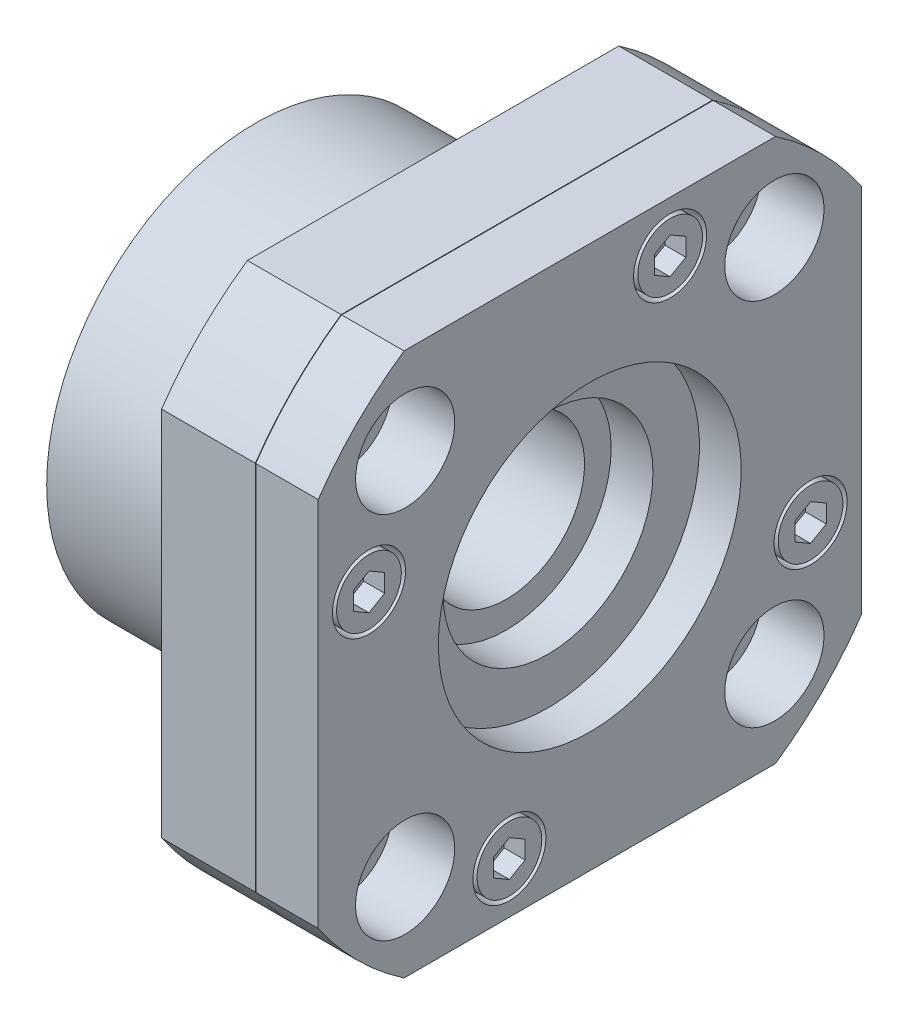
ISO-10303-21;
HEADER;
FILE_DESCRIPTION(('STEP AP214'),'2;1');
FILE_NAME('part.step','',(''),(''),'','','');
FILE_SCHEMA(('AUTOMOTIVE_DESIGN { 1 0 10303 214 1 1 1 1 }'));
ENDSEC;
DATA;
#1=APPLICATION_CONTEXT('core data for automotive mechanical design processes');
#2=APPLICATION_PROTOCOL_DEFINITION('international standard','automotive_design',2000,#1);
#3=PRODUCT_CONTEXT('',#1,'mechanical');
#4=PRODUCT('Part','Part','',(#3));
#5=PRODUCT_RELATED_PRODUCT_CATEGORY('part','',(#4));
#6=PRODUCT_DEFINITION_FORMATION('','',#4);
#7=PRODUCT_DEFINITION_CONTEXT('part definition',#1,'design');
#8=PRODUCT_DEFINITION('design','',#6,#7);
#9=PRODUCT_DEFINITION_SHAPE('','',#8);
#10=(LENGTH_UNIT() NAMED_UNIT(*) SI_UNIT(.MILLI.,.METRE.));
#11=(NAMED_UNIT(*) PLANE_ANGLE_UNIT() SI_UNIT($,.RADIAN.));
#12=(NAMED_UNIT(*) SI_UNIT($,.STERADIAN.) SOLID_ANGLE_UNIT());
#13=UNCERTAINTY_MEASURE_WITH_UNIT(LENGTH_MEASURE(1.E-05),#10,'distance_accuracy_value','');
#14=(GEOMETRIC_REPRESENTATION_CONTEXT(3) GLOBAL_UNCERTAINTY_ASSIGNED_CONTEXT((#13)) GLOBAL_UNIT_ASSIGNED_CONTEXT((#10,
#11,#12)) REPRESENTATION_CONTEXT('',''));
#15=CARTESIAN_POINT('',(0.,0.,0.));
#16=DIRECTION('',(0.,0.,1.));
#17=DIRECTION('',(1.,0.,0.));
#18=AXIS2_PLACEMENT_3D('',#15,#16,#17);
#19=CARTESIAN_POINT('',(32.,2.05876982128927E-11,-2.05876982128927E-11));
#20=DIRECTION('',(-1.,0.,0.));
#21=DIRECTION('',(0.,0.,1.));
#22=AXIS2_PLACEMENT_3D('',#19,#20,#21);
#23=CYLINDRICAL_SURFACE('',#22,31.5000000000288);
#24=CARTESIAN_POINT('',(25.975,2.05876982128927E-11,-2.05876982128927E-11));
#25=DIRECTION('',(1.,0.,0.));
#26=DIRECTION('',(0.,0.,-1.));
#27=AXIS2_PLACEMENT_3D('',#24,#25,#26);
#28=CIRCLE('',#27,31.5000000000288);
#29=CARTESIAN_POINT('',(25.975,-17.783419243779,26.));
#30=VERTEX_POINT('',#29);
#31=CARTESIAN_POINT('',(25.975,-26.,17.783419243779));
#32=VERTEX_POINT('',#31);
#33=EDGE_CURVE('E608',#30,#32,#28,.T.);
#34=ORIENTED_EDGE('',*,*,#33,.F.);
#35=DIRECTION('',(-1.,0.,0.));
#36=VECTOR('',#35,1.);
#37=CARTESIAN_POINT('',(32.,-17.783419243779,26.));
#38=LINE('',#37,#36);
#39=CARTESIAN_POINT('',(17.,-17.783419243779,26.));
#40=VERTEX_POINT('',#39);
#41=EDGE_CURVE('E778',#30,#40,#38,.T.);
#42=ORIENTED_EDGE('',*,*,#41,.T.);
#43=CARTESIAN_POINT('',(17.,2.05876982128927E-11,-2.05876982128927E-11));
#44=DIRECTION('',(1.,0.,0.));
#45=DIRECTION('',(0.,0.,-1.));
#46=AXIS2_PLACEMENT_3D('',#43,#44,#45);
#47=CIRCLE('',#46,31.5000000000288);
#48=CARTESIAN_POINT('',(17.,-26.,17.783419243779));
#49=VERTEX_POINT('',#48);
#50=EDGE_CURVE('E759',#40,#49,#47,.T.);
#51=ORIENTED_EDGE('',*,*,#50,.T.);
#52=DIRECTION('',(-1.,0.,0.));
#53=VECTOR('',#52,1.);
#54=CARTESIAN_POINT('',(32.,-26.,17.783419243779));
#55=LINE('',#54,#53);
#56=EDGE_CURVE('E828',#32,#49,#55,.T.);
#57=ORIENTED_EDGE('',*,*,#56,.F.);
#58=EDGE_LOOP('',(#34,#42,#51,#57));
#59=FACE_BOUND('',#58,.T.);
#60=ADVANCED_FACE('F35',(#59),#23,.T.);
#61=CARTESIAN_POINT('',(32.,-26.,17.783419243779));
#62=DIRECTION('',(0.,1.,0.));
#63=DIRECTION('',(0.,0.,1.));
#64=AXIS2_PLACEMENT_3D('',#61,#62,#63);
#65=PLANE('',#64);
#66=DIRECTION('',(0.,0.,-1.));
#67=VECTOR('',#66,1.);
#68=CARTESIAN_POINT('',(25.975,-26.,17.783419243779));
#69=LINE('',#68,#67);
#70=CARTESIAN_POINT('',(25.975,-25.9999999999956,-17.783419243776));
#71=VERTEX_POINT('',#70);
#72=EDGE_CURVE('E610',#32,#71,#69,.T.);
#73=ORIENTED_EDGE('',*,*,#72,.F.);
#74=ORIENTED_EDGE('',*,*,#56,.T.);
#75=DIRECTION('',(0.,0.,-1.));
#76=VECTOR('',#75,1.);
#77=CARTESIAN_POINT('',(17.,-26.,17.783419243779));
#78=LINE('',#77,#76);
#79=CARTESIAN_POINT('',(17.,-25.9999999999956,-17.783419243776));
#80=VERTEX_POINT('',#79);
#81=EDGE_CURVE('E781',#49,#80,#78,.T.);
#82=ORIENTED_EDGE('',*,*,#81,.T.);
#83=DIRECTION('',(-1.,0.,0.));
#84=VECTOR('',#83,1.);
#85=CARTESIAN_POINT('',(32.,-25.9999999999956,-17.783419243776));
#86=LINE('',#85,#84);
#87=EDGE_CURVE('E824',#71,#80,#86,.T.);
#88=ORIENTED_EDGE('',*,*,#87,.F.);
#89=EDGE_LOOP('',(#73,#74,#82,#88));
#90=FACE_BOUND('',#89,.T.);
#91=ADVANCED_FACE('F907',(#90),#65,.F.);
#92=CARTESIAN_POINT('',(32.,2.05876982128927E-11,-2.05876982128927E-11));
#93=DIRECTION('',(-1.,0.,0.));
#94=DIRECTION('',(0.,0.,1.));
#95=AXIS2_PLACEMENT_3D('',#92,#93,#94);
#96=CYLINDRICAL_SURFACE('',#95,31.5000000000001);
#97=CARTESIAN_POINT('',(25.975,2.05876982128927E-11,-2.05876982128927E-11));
#98=DIRECTION('',(1.,0.,0.));
#99=DIRECTION('',(0.,0.,-1.));
#100=AXIS2_PLACEMENT_3D('',#97,#98,#99);
#101=CIRCLE('',#100,31.5000000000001);
#102=CARTESIAN_POINT('',(25.975,-17.783419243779,-26.));
#103=VERTEX_POINT('',#102);
#104=EDGE_CURVE('E612',#71,#103,#101,.T.);
#105=ORIENTED_EDGE('',*,*,#104,.F.);
#106=ORIENTED_EDGE('',*,*,#87,.T.);
#107=CARTESIAN_POINT('',(17.,2.05876982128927E-11,-2.05876982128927E-11));
#108=DIRECTION('',(1.,0.,0.));
#109=DIRECTION('',(0.,0.,-1.));
#110=AXIS2_PLACEMENT_3D('',#107,#108,#109);
#111=CIRCLE('',#110,31.5000000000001);
#112=CARTESIAN_POINT('',(17.,-17.783419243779,-26.));
#113=VERTEX_POINT('',#112);
#114=EDGE_CURVE('E784',#80,#113,#111,.T.);
#115=ORIENTED_EDGE('',*,*,#114,.T.);
#116=DIRECTION('',(-1.,0.,0.));
#117=VECTOR('',#116,1.);
#118=CARTESIAN_POINT('',(32.,-17.783419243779,-26.));
#119=LINE('',#118,#117);
#120=EDGE_CURVE('E820',#103,#113,#119,.T.);
#121=ORIENTED_EDGE('',*,*,#120,.F.);
#122=EDGE_LOOP('',(#105,#106,#115,#121));
#123=FACE_BOUND('',#122,.T.);
#124=ADVANCED_FACE('F913',(#123),#96,.T.);
#125=CARTESIAN_POINT('',(32.,-17.783419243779,-26.));
#126=DIRECTION('',(0.,0.,1.));
#127=DIRECTION('',(1.,0.,0.));
#128=AXIS2_PLACEMENT_3D('',#125,#126,#127);
#129=PLANE('',#128);
#130=DIRECTION('',(0.,1.,0.));
#131=VECTOR('',#130,1.);
#132=CARTESIAN_POINT('',(25.975,-17.783419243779,-26.));
#133=LINE('',#132,#131);
#134=CARTESIAN_POINT('',(25.975,17.783419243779,-26.));
#135=VERTEX_POINT('',#134);
#136=EDGE_CURVE('E614',#103,#135,#133,.T.);
#137=ORIENTED_EDGE('',*,*,#136,.F.);
#138=ORIENTED_EDGE('',*,*,#120,.T.);
#139=DIRECTION('',(0.,1.,0.));
#140=VECTOR('',#139,1.);
#141=CARTESIAN_POINT('',(17.,-17.783419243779,-26.));
#142=LINE('',#141,#140);
#143=CARTESIAN_POINT('',(17.,17.783419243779,-26.));
#144=VERTEX_POINT('',#143);
#145=EDGE_CURVE('E787',#113,#144,#142,.T.);
#146=ORIENTED_EDGE('',*,*,#145,.T.);
#147=DIRECTION('',(-1.,0.,0.));
#148=VECTOR('',#147,1.);
#149=CARTESIAN_POINT('',(32.,17.783419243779,-26.));
#150=LINE('',#149,#148);
#151=EDGE_CURVE('E816',#135,#144,#150,.T.);
#152=ORIENTED_EDGE('',*,*,#151,.F.);
#153=EDGE_LOOP('',(#137,#138,#146,#152));
#154=FACE_BOUND('',#153,.T.);
#155=ADVANCED_FACE('F1090',(#154),#129,.F.);
#156=CARTESIAN_POINT('',(32.,2.05876982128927E-11,-2.05876982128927E-11));
#157=DIRECTION('',(-1.,0.,0.));
#158=DIRECTION('',(0.,0.,1.));
#159=AXIS2_PLACEMENT_3D('',#156,#157,#158);
#160=CYLINDRICAL_SURFACE('',#159,31.4999999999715);
#161=CARTESIAN_POINT('',(25.975,2.05876982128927E-11,-2.05876982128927E-11));
#162=DIRECTION('',(1.,0.,0.));
#163=DIRECTION('',(0.,0.,-1.));
#164=AXIS2_PLACEMENT_3D('',#161,#162,#163);
#165=CIRCLE('',#164,31.4999999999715);
#166=CARTESIAN_POINT('',(25.975,26.,-17.783419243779));
#167=VERTEX_POINT('',#166);
#168=EDGE_CURVE('E616',#135,#167,#165,.T.);
#169=ORIENTED_EDGE('',*,*,#168,.F.);
#170=ORIENTED_EDGE('',*,*,#151,.T.);
#171=CARTESIAN_POINT('',(17.,2.05876982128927E-11,-2.05876982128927E-11));
#172=DIRECTION('',(1.,0.,0.));
#173=DIRECTION('',(0.,0.,-1.));
#174=AXIS2_PLACEMENT_3D('',#171,#172,#173);
#175=CIRCLE('',#174,31.4999999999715);
#176=CARTESIAN_POINT('',(17.,26.,-17.783419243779));
#177=VERTEX_POINT('',#176);
#178=EDGE_CURVE('E790',#144,#177,#175,.T.);
#179=ORIENTED_EDGE('',*,*,#178,.T.);
#180=DIRECTION('',(-1.,0.,0.));
#181=VECTOR('',#180,1.);
#182=CARTESIAN_POINT('',(32.,26.,-17.783419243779));
#183=LINE('',#182,#181);
#184=EDGE_CURVE('E812',#167,#177,#183,.T.);
#185=ORIENTED_EDGE('',*,*,#184,.F.);
#186=EDGE_LOOP('',(#169,#170,#179,#185));
#187=FACE_BOUND('',#186,.T.);
#188=ADVANCED_FACE('F1098',(#187),#160,.T.);
#189=CARTESIAN_POINT('',(32.,26.,-17.783419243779));
#190=DIRECTION('',(0.,-1.,0.));
#191=DIRECTION('',(0.,0.,-1.));
#192=AXIS2_PLACEMENT_3D('',#189,#190,#191);
#193=PLANE('',#192);
#194=DIRECTION('',(0.,0.,1.));
#195=VECTOR('',#194,1.);
#196=CARTESIAN_POINT('',(25.975,26.,-17.783419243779));
#197=LINE('',#196,#195);
#198=CARTESIAN_POINT('',(25.975,26.0000000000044,17.783419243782));
#199=VERTEX_POINT('',#198);
#200=EDGE_CURVE('E618',#167,#199,#197,.T.);
#201=ORIENTED_EDGE('',*,*,#200,.F.);
#202=ORIENTED_EDGE('',*,*,#184,.T.);
#203=DIRECTION('',(0.,0.,1.));
#204=VECTOR('',#203,1.);
#205=CARTESIAN_POINT('',(17.,26.,-17.783419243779));
#206=LINE('',#205,#204);
#207=CARTESIAN_POINT('',(17.,26.0000000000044,17.783419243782));
#208=VERTEX_POINT('',#207);
#209=EDGE_CURVE('E793',#177,#208,#206,.T.);
#210=ORIENTED_EDGE('',*,*,#209,.T.);
#211=DIRECTION('',(-1.,0.,0.));
#212=VECTOR('',#211,1.);
#213=CARTESIAN_POINT('',(32.,26.0000000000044,17.783419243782));
#214=LINE('',#213,#212);
#215=EDGE_CURVE('E808',#199,#208,#214,.T.);
#216=ORIENTED_EDGE('',*,*,#215,.F.);
#217=EDGE_LOOP('',(#201,#202,#210,#216));
#218=FACE_BOUND('',#217,.T.);
#219=ADVANCED_FACE('F1106',(#218),#193,.F.);
#220=CARTESIAN_POINT('',(32.,2.05876982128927E-11,-2.05876982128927E-11));
#221=DIRECTION('',(-1.,0.,0.));
#222=DIRECTION('',(0.,0.,1.));
#223=AXIS2_PLACEMENT_3D('',#220,#221,#222);
#224=CYLINDRICAL_SURFACE('',#223,31.5000000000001);
#225=CARTESIAN_POINT('',(25.975,2.05876982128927E-11,-2.05876982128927E-11));
#226=DIRECTION('',(1.,0.,0.));
#227=DIRECTION('',(0.,0.,-1.));
#228=AXIS2_PLACEMENT_3D('',#225,#226,#227);
#229=CIRCLE('',#228,31.5000000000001);
#230=CARTESIAN_POINT('',(25.975,17.783419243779,26.));
#231=VERTEX_POINT('',#230);
#232=EDGE_CURVE('E620',#199,#231,#229,.T.);
#233=ORIENTED_EDGE('',*,*,#232,.F.);
#234=ORIENTED_EDGE('',*,*,#215,.T.);
#235=CARTESIAN_POINT('',(17.,2.05876982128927E-11,-2.05876982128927E-11));
#236=DIRECTION('',(1.,0.,0.));
#237=DIRECTION('',(0.,0.,-1.));
#238=AXIS2_PLACEMENT_3D('',#235,#236,#237);
#239=CIRCLE('',#238,31.5000000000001);
#240=CARTESIAN_POINT('',(17.,17.783419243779,26.));
#241=VERTEX_POINT('',#240);
#242=EDGE_CURVE('E796',#208,#241,#239,.T.);
#243=ORIENTED_EDGE('',*,*,#242,.T.);
#244=DIRECTION('',(-1.,0.,0.));
#245=VECTOR('',#244,1.);
#246=CARTESIAN_POINT('',(32.,17.783419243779,26.));
#247=LINE('',#246,#245);
#248=EDGE_CURVE('E804',#231,#241,#247,.T.);
#249=ORIENTED_EDGE('',*,*,#248,.F.);
#250=EDGE_LOOP('',(#233,#234,#243,#249));
#251=FACE_BOUND('',#250,.T.);
#252=ADVANCED_FACE('F889',(#251),#224,.T.);
#253=CARTESIAN_POINT('',(32.,17.783419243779,26.));
#254=DIRECTION('',(0.,0.,-1.));
#255=DIRECTION('',(-1.,0.,0.));
#256=AXIS2_PLACEMENT_3D('',#253,#254,#255);
#257=PLANE('',#256);
#258=DIRECTION('',(0.,-1.,0.));
#259=VECTOR('',#258,1.);
#260=CARTESIAN_POINT('',(25.975,17.783419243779,26.));
#261=LINE('',#260,#259);
#262=EDGE_CURVE('E622',#231,#30,#261,.T.);
#263=ORIENTED_EDGE('',*,*,#262,.F.);
#264=ORIENTED_EDGE('',*,*,#248,.T.);
#265=DIRECTION('',(0.,-1.,0.));
#266=VECTOR('',#265,1.);
#267=CARTESIAN_POINT('',(17.,17.783419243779,26.));
#268=LINE('',#267,#266);
#269=EDGE_CURVE('E764',#241,#40,#268,.T.);
#270=ORIENTED_EDGE('',*,*,#269,.T.);
#271=ORIENTED_EDGE('',*,*,#41,.F.);
#272=EDGE_LOOP('',(#263,#264,#270,#271));
#273=FACE_BOUND('',#272,.T.);
#274=ADVANCED_FACE('F881',(#273),#257,.F.);
#275=CARTESIAN_POINT('',(32.,2.05876982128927E-11,-2.05876982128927E-11));
#276=DIRECTION('',(1.,0.,0.));
#277=DIRECTION('',(0.,0.,-1.));
#278=AXIS2_PLACEMENT_3D('',#275,#276,#277);
#279=PLANE('',#278);
#280=CARTESIAN_POINT('',(32.,21.1430839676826,-7.695453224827));
#281=DIRECTION('',(1.,0.,0.));
#282=DIRECTION('',(0.,0.,-1.));
#283=AXIS2_PLACEMENT_3D('',#280,#281,#282);
#284=CIRCLE('',#283,3.5);
#285=CARTESIAN_POINT('',(32.,21.1430839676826,-11.195453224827));
#286=VERTEX_POINT('',#285);
#287=EDGE_CURVE('E540',#286,#286,#284,.T.);
#288=ORIENTED_EDGE('',*,*,#287,.F.);
#289=EDGE_LOOP('',(#288));
#290=FACE_BOUND('',#289,.T.);
#291=CARTESIAN_POINT('',(32.,-7.6954532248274,-21.143083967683));
#292=DIRECTION('',(1.,0.,0.));
#293=DIRECTION('',(0.,0.,-1.));
#294=AXIS2_PLACEMENT_3D('',#291,#292,#293);
#295=CIRCLE('',#294,3.5);
#296=CARTESIAN_POINT('',(32.,-7.6954532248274,-24.643083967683));
#297=VERTEX_POINT('',#296);
#298=EDGE_CURVE('E552',#297,#297,#295,.T.);
#299=ORIENTED_EDGE('',*,*,#298,.F.);
#300=EDGE_LOOP('',(#299));
#301=FACE_BOUND('',#300,.T.);
#302=CARTESIAN_POINT('',(32.,-21.1430839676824,7.695453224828));
#303=DIRECTION('',(1.,0.,0.));
#304=DIRECTION('',(0.,0.,-1.));
#305=AXIS2_PLACEMENT_3D('',#302,#303,#304);
#306=CIRCLE('',#305,3.5);
#307=CARTESIAN_POINT('',(32.,-21.1430839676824,4.195453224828));
#308=VERTEX_POINT('',#307);
#309=EDGE_CURVE('E564',#308,#308,#306,.T.);
#310=ORIENTED_EDGE('',*,*,#309,.F.);
#311=EDGE_LOOP('',(#310));
#312=FACE_BOUND('',#311,.T.);
#313=CARTESIAN_POINT('',(32.,7.6954532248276,21.143083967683));
#314=DIRECTION('',(1.,0.,0.));
#315=DIRECTION('',(0.,0.,-1.));
#316=AXIS2_PLACEMENT_3D('',#313,#314,#315);
#317=CIRCLE('',#316,3.5);
#318=CARTESIAN_POINT('',(32.,7.6954532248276,17.643083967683));
#319=VERTEX_POINT('',#318);
#320=EDGE_CURVE('E576',#319,#319,#317,.T.);
#321=ORIENTED_EDGE('',*,*,#320,.F.);
#322=EDGE_LOOP('',(#321));
#323=FACE_BOUND('',#322,.T.);
#324=CARTESIAN_POINT('',(32.,17.677669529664,-17.677669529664));
#325=DIRECTION('',(-1.,0.,0.));
#326=DIRECTION('',(0.,0.,1.));
#327=AXIS2_PLACEMENT_3D('',#324,#325,#326);
#328=CIRCLE('',#327,4.75000000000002);
#329=CARTESIAN_POINT('',(32.,17.677669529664,-12.927669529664));
#330=VERTEX_POINT('',#329);
#331=EDGE_CURVE('E693',#330,#330,#328,.T.);
#332=ORIENTED_EDGE('',*,*,#331,.T.);
#333=EDGE_LOOP('',(#332));
#334=FACE_BOUND('',#333,.T.);
#335=CARTESIAN_POINT('',(32.,-17.677669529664,17.677669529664));
#336=DIRECTION('',(-1.,0.,0.));
#337=DIRECTION('',(0.,0.,1.));
#338=AXIS2_PLACEMENT_3D('',#335,#336,#337);
#339=CIRCLE('',#338,4.75000000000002);
#340=CARTESIAN_POINT('',(32.,-17.677669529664,22.427669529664));
#341=VERTEX_POINT('',#340);
#342=EDGE_CURVE('E717',#341,#341,#339,.T.);
#343=ORIENTED_EDGE('',*,*,#342,.T.);
#344=EDGE_LOOP('',(#343));
#345=FACE_BOUND('',#344,.T.);
#346=CARTESIAN_POINT('',(32.,2.05876982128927E-11,-2.05876982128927E-11));
#347=DIRECTION('',(1.,0.,0.));
#348=DIRECTION('',(0.,0.,-1.));
#349=AXIS2_PLACEMENT_3D('',#346,#347,#348);
#350=CIRCLE('',#349,31.5000000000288);
#351=CARTESIAN_POINT('',(32.,-17.783419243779,26.));
#352=VERTEX_POINT('',#351);
#353=CARTESIAN_POINT('',(32.,-26.,17.783419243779));
#354=VERTEX_POINT('',#353);
#355=EDGE_CURVE('E760',#352,#354,#350,.T.);
#356=ORIENTED_EDGE('',*,*,#355,.T.);
#357=DIRECTION('',(0.,0.,-1.));
#358=VECTOR('',#357,1.);
#359=CARTESIAN_POINT('',(32.,-26.,17.783419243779));
#360=LINE('',#359,#358);
#361=CARTESIAN_POINT('',(32.,-25.9999999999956,-17.783419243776));
#362=VERTEX_POINT('',#361);
#363=EDGE_CURVE('E763',#354,#362,#360,.T.);
#364=ORIENTED_EDGE('',*,*,#363,.T.);
#365=CARTESIAN_POINT('',(32.,2.05876982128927E-11,-2.05876982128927E-11));
#366=DIRECTION('',(1.,0.,0.));
#367=DIRECTION('',(0.,0.,-1.));
#368=AXIS2_PLACEMENT_3D('',#365,#366,#367);
#369=CIRCLE('',#368,31.5000000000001);
#370=CARTESIAN_POINT('',(32.,-17.783419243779,-26.));
#371=VERTEX_POINT('',#370);
#372=EDGE_CURVE('E766',#362,#371,#369,.T.);
#373=ORIENTED_EDGE('',*,*,#372,.T.);
#374=DIRECTION('',(0.,1.,0.));
#375=VECTOR('',#374,1.);
#376=CARTESIAN_POINT('',(32.,-17.783419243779,-26.));
#377=LINE('',#376,#375);
#378=CARTESIAN_POINT('',(32.,17.783419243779,-26.));
#379=VERTEX_POINT('',#378);
#380=EDGE_CURVE('E768',#371,#379,#377,.T.);
#381=ORIENTED_EDGE('',*,*,#380,.T.);
#382=CARTESIAN_POINT('',(32.,2.05876982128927E-11,-2.05876982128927E-11));
#383=DIRECTION('',(1.,0.,0.));
#384=DIRECTION('',(0.,0.,-1.));
#385=AXIS2_PLACEMENT_3D('',#382,#383,#384);
#386=CIRCLE('',#385,31.4999999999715);
#387=CARTESIAN_POINT('',(32.,26.,-17.783419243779));
#388=VERTEX_POINT('',#387);
#389=EDGE_CURVE('E770',#379,#388,#386,.T.);
#390=ORIENTED_EDGE('',*,*,#389,.T.);
#391=DIRECTION('',(0.,0.,1.));
#392=VECTOR('',#391,1.);
#393=CARTESIAN_POINT('',(32.,26.,-17.783419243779));
#394=LINE('',#393,#392);
#395=CARTESIAN_POINT('',(32.,26.0000000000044,17.783419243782));
#396=VERTEX_POINT('',#395);
#397=EDGE_CURVE('E772',#388,#396,#394,.T.);
#398=ORIENTED_EDGE('',*,*,#397,.T.);
#399=CARTESIAN_POINT('',(32.,2.05876982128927E-11,-2.05876982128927E-11));
#400=DIRECTION('',(1.,0.,0.));
#401=DIRECTION('',(0.,0.,-1.));
#402=AXIS2_PLACEMENT_3D('',#399,#400,#401);
#403=CIRCLE('',#402,31.5000000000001);
#404=CARTESIAN_POINT('',(32.,17.783419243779,26.));
#405=VERTEX_POINT('',#404);
#406=EDGE_CURVE('E774',#396,#405,#403,.T.);
#407=ORIENTED_EDGE('',*,*,#406,.T.);
#408=DIRECTION('',(0.,-1.,0.));
#409=VECTOR('',#408,1.);
#410=CARTESIAN_POINT('',(32.,17.783419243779,26.));
#411=LINE('',#410,#409);
#412=EDGE_CURVE('E776',#405,#352,#411,.T.);
#413=ORIENTED_EDGE('',*,*,#412,.T.);
#414=EDGE_LOOP('',(#356,#364,#373,#381,#390,#398,#407,#413));
#415=FACE_BOUND('',#414,.T.);
#416=CARTESIAN_POINT('',(32.,0.,0.));
#417=DIRECTION('',(-1.,0.,0.));
#418=DIRECTION('',(0.,0.,1.));
#419=AXIS2_PLACEMENT_3D('',#416,#417,#418);
#420=CIRCLE('',#419,14.5);
#421=CARTESIAN_POINT('',(32.,0.,14.5));
#422=VERTEX_POINT('',#421);
#423=EDGE_CURVE('E729',#422,#422,#420,.T.);
#424=ORIENTED_EDGE('',*,*,#423,.T.);
#425=EDGE_LOOP('',(#424));
#426=FACE_BOUND('',#425,.T.);
#427=CARTESIAN_POINT('',(32.,17.677669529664,17.677669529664));
#428=DIRECTION('',(-1.,0.,0.));
#429=DIRECTION('',(0.,0.,1.));
#430=AXIS2_PLACEMENT_3D('',#427,#428,#429);
#431=CIRCLE('',#430,4.75000000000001);
#432=CARTESIAN_POINT('',(32.,17.677669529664,22.427669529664));
#433=VERTEX_POINT('',#432);
#434=EDGE_CURVE('E705',#433,#433,#431,.T.);
#435=ORIENTED_EDGE('',*,*,#434,.T.);
#436=EDGE_LOOP('',(#435));
#437=FACE_BOUND('',#436,.T.);
#438=CARTESIAN_POINT('',(32.,-17.677669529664,-17.677669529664));
#439=DIRECTION('',(-1.,0.,0.));
#440=DIRECTION('',(0.,0.,1.));
#441=AXIS2_PLACEMENT_3D('',#438,#439,#440);
#442=CIRCLE('',#441,4.75000000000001);
#443=CARTESIAN_POINT('',(32.,-17.677669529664,-12.927669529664));
#444=VERTEX_POINT('',#443);
#445=EDGE_CURVE('E681',#444,#444,#442,.T.);
#446=ORIENTED_EDGE('',*,*,#445,.T.);
#447=EDGE_LOOP('',(#446));
#448=FACE_BOUND('',#447,.T.);
#449=ADVANCED_FACE('F853',(#290,#301,#312,#323,#334,#345,#415,#426,#437,#448),#279,.T.);
#450=CARTESIAN_POINT('',(17.,2.05876982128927E-11,-2.05876982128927E-11));
#451=DIRECTION('',(1.,0.,0.));
#452=DIRECTION('',(0.,0.,-1.));
#453=AXIS2_PLACEMENT_3D('',#450,#451,#452);
#454=PLANE('',#453);
#455=CARTESIAN_POINT('',(17.,17.677669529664,-17.677669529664));
#456=DIRECTION('',(-1.,0.,0.));
#457=DIRECTION('',(0.,0.,1.));
#458=AXIS2_PLACEMENT_3D('',#455,#456,#457);
#459=CIRCLE('',#458,2.75000000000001);
#460=CARTESIAN_POINT('',(17.,17.677669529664,-14.927669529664));
#461=VERTEX_POINT('',#460);
#462=EDGE_CURVE('E702',#461,#461,#459,.T.);
#463=ORIENTED_EDGE('',*,*,#462,.F.);
#464=EDGE_LOOP('',(#463));
#465=FACE_BOUND('',#464,.T.);
#466=CARTESIAN_POINT('',(17.,-17.677669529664,17.677669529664));
#467=DIRECTION('',(-1.,0.,0.));
#468=DIRECTION('',(0.,0.,1.));
#469=AXIS2_PLACEMENT_3D('',#466,#467,#468);
#470=CIRCLE('',#469,2.75000000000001);
#471=CARTESIAN_POINT('',(17.,-17.677669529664,20.427669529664));
#472=VERTEX_POINT('',#471);
#473=EDGE_CURVE('E726',#472,#472,#470,.T.);
#474=ORIENTED_EDGE('',*,*,#473,.F.);
#475=EDGE_LOOP('',(#474));
#476=FACE_BOUND('',#475,.T.);
#477=ORIENTED_EDGE('',*,*,#50,.F.);
#478=ORIENTED_EDGE('',*,*,#269,.F.);
#479=ORIENTED_EDGE('',*,*,#242,.F.);
#480=ORIENTED_EDGE('',*,*,#209,.F.);
#481=ORIENTED_EDGE('',*,*,#178,.F.);
#482=ORIENTED_EDGE('',*,*,#145,.F.);
#483=ORIENTED_EDGE('',*,*,#114,.F.);
#484=ORIENTED_EDGE('',*,*,#81,.F.);
#485=EDGE_LOOP('',(#477,#478,#479,#480,#481,#482,#483,#484));
#486=FACE_BOUND('',#485,.T.);
#487=CARTESIAN_POINT('',(17.,0.,0.));
#488=DIRECTION('',(-1.,0.,0.));
#489=DIRECTION('',(0.,0.,1.));
#490=AXIS2_PLACEMENT_3D('',#487,#488,#489);
#491=CIRCLE('',#490,20.2999999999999);
#492=CARTESIAN_POINT('',(17.,0.,20.2999999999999));
#493=VERTEX_POINT('',#492);
#494=EDGE_CURVE('E832',#493,#493,#491,.F.);
#495=ORIENTED_EDGE('',*,*,#494,.T.);
#496=EDGE_LOOP('',(#495));
#497=FACE_BOUND('',#496,.T.);
#498=CARTESIAN_POINT('',(17.,17.677669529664,17.677669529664));
#499=DIRECTION('',(-1.,0.,0.));
#500=DIRECTION('',(0.,0.,1.));
#501=AXIS2_PLACEMENT_3D('',#498,#499,#500);
#502=CIRCLE('',#501,2.75000000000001);
#503=CARTESIAN_POINT('',(17.,17.677669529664,20.427669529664));
#504=VERTEX_POINT('',#503);
#505=EDGE_CURVE('E714',#504,#504,#502,.T.);
#506=ORIENTED_EDGE('',*,*,#505,.F.);
#507=EDGE_LOOP('',(#506));
#508=FACE_BOUND('',#507,.T.);
#509=CARTESIAN_POINT('',(17.,-17.677669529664,-17.677669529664));
#510=DIRECTION('',(-1.,0.,0.));
#511=DIRECTION('',(0.,0.,1.));
#512=AXIS2_PLACEMENT_3D('',#509,#510,#511);
#513=CIRCLE('',#512,2.75000000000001);
#514=CARTESIAN_POINT('',(17.,-17.677669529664,-14.927669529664));
#515=VERTEX_POINT('',#514);
#516=EDGE_CURVE('E690',#515,#515,#513,.T.);
#517=ORIENTED_EDGE('',*,*,#516,.F.);
#518=EDGE_LOOP('',(#517));
#519=FACE_BOUND('',#518,.T.);
#520=ADVANCED_FACE('F850',(#465,#476,#486,#497,#508,#519),#454,.F.);
#521=CARTESIAN_POINT('',(0.,0.,0.));
#522=DIRECTION('',(1.,0.,0.));
#523=DIRECTION('',(0.,0.,-1.));
#524=AXIS2_PLACEMENT_3D('',#521,#522,#523);
#525=PLANE('',#524);
#526=CARTESIAN_POINT('',(0.,0.,0.));
#527=DIRECTION('',(-1.,0.,0.));
#528=DIRECTION('',(0.,0.,1.));
#529=AXIS2_PLACEMENT_3D('',#526,#527,#528);
#530=CIRCLE('',#529,20.);
#531=CARTESIAN_POINT('',(0.,0.,20.));
#532=VERTEX_POINT('',#531);
#533=EDGE_CURVE('E43',#532,#532,#530,.T.);
#534=ORIENTED_EDGE('',*,*,#533,.T.);
#535=EDGE_LOOP('',(#534));
#536=FACE_BOUND('',#535,.T.);
#537=CARTESIAN_POINT('',(0.,0.,0.));
#538=DIRECTION('',(-1.,0.,0.));
#539=DIRECTION('',(0.,0.,1.));
#540=AXIS2_PLACEMENT_3D('',#537,#538,#539);
#541=CIRCLE('',#540,14.5);
#542=CARTESIAN_POINT('',(0.,0.,14.5));
#543=VERTEX_POINT('',#542);
#544=EDGE_CURVE('E756',#543,#543,#541,.T.);
#545=ORIENTED_EDGE('',*,*,#544,.F.);
#546=EDGE_LOOP('',(#545));
#547=FACE_BOUND('',#546,.T.);
#548=ADVANCED_FACE('F837',(#536,#547),#525,.F.);
#549=CARTESIAN_POINT('',(16.7000000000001,0.,0.));
#550=DIRECTION('',(-1.,0.,0.));
#551=DIRECTION('',(0.,0.,1.));
#552=AXIS2_PLACEMENT_3D('',#549,#550,#551);
#553=TOROIDAL_SURFACE('',#552,20.2999999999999,0.299999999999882);
#554=CARTESIAN_POINT('',(16.7,0.,0.));
#555=DIRECTION('',(-1.,0.,0.));
#556=DIRECTION('',(0.,0.,1.));
#557=AXIS2_PLACEMENT_3D('',#554,#555,#556);
#558=CIRCLE('',#557,20.);
#559=CARTESIAN_POINT('',(16.7,0.,20.));
#560=VERTEX_POINT('',#559);
#561=EDGE_CURVE('E11',#560,#560,#558,.T.);
#562=ORIENTED_EDGE('',*,*,#561,.F.);
#563=EDGE_LOOP('',(#562));
#564=FACE_BOUND('',#563,.T.);
#565=ORIENTED_EDGE('',*,*,#494,.F.);
#566=EDGE_LOOP('',(#565));
#567=FACE_BOUND('',#566,.T.);
#568=ADVANCED_FACE('F37',(#564,#567),#553,.F.);
#569=CARTESIAN_POINT('',(17.,0.,0.));
#570=DIRECTION('',(-1.,0.,0.));
#571=DIRECTION('',(0.,0.,1.));
#572=AXIS2_PLACEMENT_3D('',#569,#570,#571);
#573=CYLINDRICAL_SURFACE('',#572,20.);
#574=ORIENTED_EDGE('',*,*,#533,.F.);
#575=EDGE_LOOP('',(#574));
#576=FACE_BOUND('',#575,.T.);
#577=ORIENTED_EDGE('',*,*,#561,.T.);
#578=EDGE_LOOP('',(#577));
#579=FACE_BOUND('',#578,.T.);
#580=ADVANCED_FACE('F840',(#576,#579),#573,.T.);
#581=CARTESIAN_POINT('',(26.025,-17.783419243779,26.));
#582=VERTEX_POINT('',#581);
#583=EDGE_CURVE('E801',#352,#582,#38,.T.);
#584=ORIENTED_EDGE('',*,*,#583,.T.);
#585=CARTESIAN_POINT('',(26.025,2.05876982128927E-11,-2.05876982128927E-11));
#586=DIRECTION('',(1.,0.,0.));
#587=DIRECTION('',(0.,0.,-1.));
#588=AXIS2_PLACEMENT_3D('',#585,#586,#587);
#589=CIRCLE('',#588,31.5000000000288);
#590=CARTESIAN_POINT('',(26.025,-26.,17.783419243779));
#591=VERTEX_POINT('',#590);
#592=EDGE_CURVE('E657',#582,#591,#589,.T.);
#593=ORIENTED_EDGE('',*,*,#592,.T.);
#594=EDGE_CURVE('E829',#354,#591,#55,.T.);
#595=ORIENTED_EDGE('',*,*,#594,.F.);
#596=ORIENTED_EDGE('',*,*,#355,.F.);
#597=EDGE_LOOP('',(#584,#593,#595,#596));
#598=FACE_BOUND('',#597,.T.);
#599=ADVANCED_FACE('F843',(#598),#23,.T.);
#600=ORIENTED_EDGE('',*,*,#594,.T.);
#601=DIRECTION('',(0.,0.,-1.));
#602=VECTOR('',#601,1.);
#603=CARTESIAN_POINT('',(26.025,-26.,17.783419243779));
#604=LINE('',#603,#602);
#605=CARTESIAN_POINT('',(26.025,-25.9999999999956,-17.783419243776));
#606=VERTEX_POINT('',#605);
#607=EDGE_CURVE('E660',#591,#606,#604,.T.);
#608=ORIENTED_EDGE('',*,*,#607,.T.);
#609=EDGE_CURVE('E825',#362,#606,#86,.T.);
#610=ORIENTED_EDGE('',*,*,#609,.F.);
#611=ORIENTED_EDGE('',*,*,#363,.F.);
#612=EDGE_LOOP('',(#600,#608,#610,#611));
#613=FACE_BOUND('',#612,.T.);
#614=ADVANCED_FACE('F916',(#613),#65,.F.);
#615=ORIENTED_EDGE('',*,*,#609,.T.);
#616=CARTESIAN_POINT('',(26.025,2.05876982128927E-11,-2.05876982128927E-11));
#617=DIRECTION('',(1.,0.,0.));
#618=DIRECTION('',(0.,0.,-1.));
#619=AXIS2_PLACEMENT_3D('',#616,#617,#618);
#620=CIRCLE('',#619,31.5000000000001);
#621=CARTESIAN_POINT('',(26.025,-17.783419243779,-26.));
#622=VERTEX_POINT('',#621);
#623=EDGE_CURVE('E663',#606,#622,#620,.T.);
#624=ORIENTED_EDGE('',*,*,#623,.T.);
#625=EDGE_CURVE('E821',#371,#622,#119,.T.);
#626=ORIENTED_EDGE('',*,*,#625,.F.);
#627=ORIENTED_EDGE('',*,*,#372,.F.);
#628=EDGE_LOOP('',(#615,#624,#626,#627));
#629=FACE_BOUND('',#628,.T.);
#630=ADVANCED_FACE('F924',(#629),#96,.T.);
#631=ORIENTED_EDGE('',*,*,#625,.T.);
#632=DIRECTION('',(0.,1.,0.));
#633=VECTOR('',#632,1.);
#634=CARTESIAN_POINT('',(26.025,-17.783419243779,-26.));
#635=LINE('',#634,#633);
#636=CARTESIAN_POINT('',(26.025,17.783419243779,-26.));
#637=VERTEX_POINT('',#636);
#638=EDGE_CURVE('E666',#622,#637,#635,.T.);
#639=ORIENTED_EDGE('',*,*,#638,.T.);
#640=EDGE_CURVE('E817',#379,#637,#150,.T.);
#641=ORIENTED_EDGE('',*,*,#640,.F.);
#642=ORIENTED_EDGE('',*,*,#380,.F.);
#643=EDGE_LOOP('',(#631,#639,#641,#642));
#644=FACE_BOUND('',#643,.T.);
#645=ADVANCED_FACE('F948',(#644),#129,.F.);
#646=ORIENTED_EDGE('',*,*,#640,.T.);
#647=CARTESIAN_POINT('',(26.025,2.05876982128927E-11,-2.05876982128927E-11));
#648=DIRECTION('',(1.,0.,0.));
#649=DIRECTION('',(0.,0.,-1.));
#650=AXIS2_PLACEMENT_3D('',#647,#648,#649);
#651=CIRCLE('',#650,31.4999999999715);
#652=CARTESIAN_POINT('',(26.025,26.,-17.783419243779));
#653=VERTEX_POINT('',#652);
#654=EDGE_CURVE('E669',#637,#653,#651,.T.);
#655=ORIENTED_EDGE('',*,*,#654,.T.);
#656=EDGE_CURVE('E813',#388,#653,#183,.T.);
#657=ORIENTED_EDGE('',*,*,#656,.F.);
#658=ORIENTED_EDGE('',*,*,#389,.F.);
#659=EDGE_LOOP('',(#646,#655,#657,#658));
#660=FACE_BOUND('',#659,.T.);
#661=ADVANCED_FACE('F943',(#660),#160,.T.);
#662=ORIENTED_EDGE('',*,*,#656,.T.);
#663=DIRECTION('',(0.,0.,1.));
#664=VECTOR('',#663,1.);
#665=CARTESIAN_POINT('',(26.025,26.,-17.783419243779));
#666=LINE('',#665,#664);
#667=CARTESIAN_POINT('',(26.025,26.0000000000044,17.783419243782));
#668=VERTEX_POINT('',#667);
#669=EDGE_CURVE('E672',#653,#668,#666,.T.);
#670=ORIENTED_EDGE('',*,*,#669,.T.);
#671=EDGE_CURVE('E809',#396,#668,#214,.T.);
#672=ORIENTED_EDGE('',*,*,#671,.F.);
#673=ORIENTED_EDGE('',*,*,#397,.F.);
#674=EDGE_LOOP('',(#662,#670,#672,#673));
#675=FACE_BOUND('',#674,.T.);
#676=ADVANCED_FACE('F940',(#675),#193,.F.);
#677=ORIENTED_EDGE('',*,*,#671,.T.);
#678=CARTESIAN_POINT('',(26.025,2.05876982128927E-11,-2.05876982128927E-11));
#679=DIRECTION('',(1.,0.,0.));
#680=DIRECTION('',(0.,0.,-1.));
#681=AXIS2_PLACEMENT_3D('',#678,#679,#680);
#682=CIRCLE('',#681,31.5000000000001);
#683=CARTESIAN_POINT('',(26.025,17.783419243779,26.));
#684=VERTEX_POINT('',#683);
#685=EDGE_CURVE('E675',#668,#684,#682,.T.);
#686=ORIENTED_EDGE('',*,*,#685,.T.);
#687=EDGE_CURVE('E805',#405,#684,#247,.T.);
#688=ORIENTED_EDGE('',*,*,#687,.F.);
#689=ORIENTED_EDGE('',*,*,#406,.F.);
#690=EDGE_LOOP('',(#677,#686,#688,#689));
#691=FACE_BOUND('',#690,.T.);
#692=ADVANCED_FACE('F935',(#691),#224,.T.);
#693=ORIENTED_EDGE('',*,*,#687,.T.);
#694=DIRECTION('',(0.,-1.,0.));
#695=VECTOR('',#694,1.);
#696=CARTESIAN_POINT('',(26.025,17.783419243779,26.));
#697=LINE('',#696,#695);
#698=EDGE_CURVE('E678',#684,#582,#697,.T.);
#699=ORIENTED_EDGE('',*,*,#698,.T.);
#700=ORIENTED_EDGE('',*,*,#583,.F.);
#701=ORIENTED_EDGE('',*,*,#412,.F.);
#702=EDGE_LOOP('',(#693,#699,#700,#701));
#703=FACE_BOUND('',#702,.T.);
#704=ADVANCED_FACE('F892',(#703),#257,.F.);
#705=CARTESIAN_POINT('',(32.,0.,0.));
#706=DIRECTION('',(-1.,0.,0.));
#707=DIRECTION('',(0.,0.,1.));
#708=AXIS2_PLACEMENT_3D('',#705,#706,#707);
#709=CYLINDRICAL_SURFACE('',#708,14.5);
#710=ORIENTED_EDGE('',*,*,#544,.T.);
#711=EDGE_LOOP('',(#710));
#712=FACE_BOUND('',#711,.T.);
#713=CARTESIAN_POINT('',(2.,0.,0.));
#714=DIRECTION('',(-1.,0.,0.));
#715=DIRECTION('',(0.,0.,1.));
#716=AXIS2_PLACEMENT_3D('',#713,#714,#715);
#717=CIRCLE('',#716,14.5);
#718=CARTESIAN_POINT('',(2.,0.,14.5));
#719=VERTEX_POINT('',#718);
#720=EDGE_CURVE('E753',#719,#719,#717,.T.);
#721=ORIENTED_EDGE('',*,*,#720,.F.);
#722=EDGE_LOOP('',(#721));
#723=FACE_BOUND('',#722,.T.);
#724=ADVANCED_FACE('F1022',(#712,#723),#709,.F.);
#725=CARTESIAN_POINT('',(2.,14.5,0.));
#726=DIRECTION('',(-1.,0.,0.));
#727=DIRECTION('',(0.,0.,1.));
#728=AXIS2_PLACEMENT_3D('',#725,#726,#727);
#729=PLANE('',#728);
#730=ORIENTED_EDGE('',*,*,#720,.T.);
#731=EDGE_LOOP('',(#730));
#732=FACE_BOUND('',#731,.T.);
#733=CARTESIAN_POINT('',(2.,0.,0.));
#734=DIRECTION('',(-1.,0.,0.));
#735=DIRECTION('',(0.,0.,1.));
#736=AXIS2_PLACEMENT_3D('',#733,#734,#735);
#737=CIRCLE('',#736,10.05);
#738=CARTESIAN_POINT('',(2.,0.,10.05));
#739=VERTEX_POINT('',#738);
#740=EDGE_CURVE('E750',#739,#739,#737,.T.);
#741=ORIENTED_EDGE('',*,*,#740,.F.);
#742=EDGE_LOOP('',(#741));
#743=FACE_BOUND('',#742,.T.);
#744=ADVANCED_FACE('F1019',(#732,#743),#729,.T.);
#745=CARTESIAN_POINT('',(32.,0.,0.));
#746=DIRECTION('',(-1.,0.,0.));
#747=DIRECTION('',(0.,0.,1.));
#748=AXIS2_PLACEMENT_3D('',#745,#746,#747);
#749=CYLINDRICAL_SURFACE('',#748,10.05);
#750=ORIENTED_EDGE('',*,*,#740,.T.);
#751=EDGE_LOOP('',(#750));
#752=FACE_BOUND('',#751,.T.);
#753=CARTESIAN_POINT('',(6.,0.,0.));
#754=DIRECTION('',(-1.,0.,0.));
#755=DIRECTION('',(0.,0.,1.));
#756=AXIS2_PLACEMENT_3D('',#753,#754,#755);
#757=CIRCLE('',#756,10.05);
#758=CARTESIAN_POINT('',(6.,0.,10.05));
#759=VERTEX_POINT('',#758);
#760=EDGE_CURVE('E747',#759,#759,#757,.T.);
#761=ORIENTED_EDGE('',*,*,#760,.F.);
#762=EDGE_LOOP('',(#761));
#763=FACE_BOUND('',#762,.T.);
#764=ADVANCED_FACE('F1015',(#752,#763),#749,.F.);
#765=CARTESIAN_POINT('',(6.,10.05,0.));
#766=DIRECTION('',(-1.,0.,0.));
#767=DIRECTION('',(0.,0.,1.));
#768=AXIS2_PLACEMENT_3D('',#765,#766,#767);
#769=PLANE('',#768);
#770=ORIENTED_EDGE('',*,*,#760,.T.);
#771=EDGE_LOOP('',(#770));
#772=FACE_BOUND('',#771,.T.);
#773=CARTESIAN_POINT('',(6.,0.,0.));
#774=DIRECTION('',(-1.,0.,0.));
#775=DIRECTION('',(0.,0.,1.));
#776=AXIS2_PLACEMENT_3D('',#773,#774,#775);
#777=CIRCLE('',#776,7.5);
#778=CARTESIAN_POINT('',(6.,0.,7.5));
#779=VERTEX_POINT('',#778);
#780=EDGE_CURVE('E744',#779,#779,#777,.T.);
#781=ORIENTED_EDGE('',*,*,#780,.F.);
#782=EDGE_LOOP('',(#781));
#783=FACE_BOUND('',#782,.T.);
#784=ADVANCED_FACE('F1011',(#772,#783),#769,.T.);
#785=CARTESIAN_POINT('',(32.,0.,0.));
#786=DIRECTION('',(-1.,0.,0.));
#787=DIRECTION('',(0.,0.,1.));
#788=AXIS2_PLACEMENT_3D('',#785,#786,#787);
#789=CYLINDRICAL_SURFACE('',#788,7.5);
#790=ORIENTED_EDGE('',*,*,#780,.T.);
#791=EDGE_LOOP('',(#790));
#792=FACE_BOUND('',#791,.T.);
#793=CARTESIAN_POINT('',(24.,0.,0.));
#794=DIRECTION('',(-1.,0.,0.));
#795=DIRECTION('',(0.,0.,1.));
#796=AXIS2_PLACEMENT_3D('',#793,#794,#795);
#797=CIRCLE('',#796,7.5);
#798=CARTESIAN_POINT('',(24.,0.,7.5));
#799=VERTEX_POINT('',#798);
#800=EDGE_CURVE('E741',#799,#799,#797,.T.);
#801=ORIENTED_EDGE('',*,*,#800,.F.);
#802=EDGE_LOOP('',(#801));
#803=FACE_BOUND('',#802,.T.);
#804=ADVANCED_FACE('F1007',(#792,#803),#789,.F.);
#805=CARTESIAN_POINT('',(24.,7.5,0.));
#806=DIRECTION('',(1.,0.,0.));
#807=DIRECTION('',(0.,0.,-1.));
#808=AXIS2_PLACEMENT_3D('',#805,#806,#807);
#809=PLANE('',#808);
#810=ORIENTED_EDGE('',*,*,#800,.T.);
#811=EDGE_LOOP('',(#810));
#812=FACE_BOUND('',#811,.T.);
#813=CARTESIAN_POINT('',(24.,0.,0.));
#814=DIRECTION('',(-1.,0.,0.));
#815=DIRECTION('',(0.,0.,1.));
#816=AXIS2_PLACEMENT_3D('',#813,#814,#815);
#817=CIRCLE('',#816,10.05);
#818=CARTESIAN_POINT('',(24.,0.,10.05));
#819=VERTEX_POINT('',#818);
#820=EDGE_CURVE('E738',#819,#819,#817,.T.);
#821=ORIENTED_EDGE('',*,*,#820,.F.);
#822=EDGE_LOOP('',(#821));
#823=FACE_BOUND('',#822,.T.);
#824=ADVANCED_FACE('F1003',(#812,#823),#809,.T.);
#825=CARTESIAN_POINT('',(32.,0.,0.));
#826=DIRECTION('',(-1.,0.,0.));
#827=DIRECTION('',(0.,0.,1.));
#828=AXIS2_PLACEMENT_3D('',#825,#826,#827);
#829=CYLINDRICAL_SURFACE('',#828,10.05);
#830=ORIENTED_EDGE('',*,*,#820,.T.);
#831=EDGE_LOOP('',(#830));
#832=FACE_BOUND('',#831,.T.);
#833=CARTESIAN_POINT('',(28.,0.,0.));
#834=DIRECTION('',(-1.,0.,0.));
#835=DIRECTION('',(0.,0.,1.));
#836=AXIS2_PLACEMENT_3D('',#833,#834,#835);
#837=CIRCLE('',#836,10.05);
#838=CARTESIAN_POINT('',(28.,0.,10.05));
#839=VERTEX_POINT('',#838);
#840=EDGE_CURVE('E735',#839,#839,#837,.T.);
#841=ORIENTED_EDGE('',*,*,#840,.F.);
#842=EDGE_LOOP('',(#841));
#843=FACE_BOUND('',#842,.T.);
#844=ADVANCED_FACE('F999',(#832,#843),#829,.F.);
#845=CARTESIAN_POINT('',(28.,10.05,0.));
#846=DIRECTION('',(1.,0.,0.));
#847=DIRECTION('',(0.,0.,-1.));
#848=AXIS2_PLACEMENT_3D('',#845,#846,#847);
#849=PLANE('',#848);
#850=ORIENTED_EDGE('',*,*,#840,.T.);
#851=EDGE_LOOP('',(#850));
#852=FACE_BOUND('',#851,.T.);
#853=CARTESIAN_POINT('',(28.,0.,0.));
#854=DIRECTION('',(-1.,0.,0.));
#855=DIRECTION('',(0.,0.,1.));
#856=AXIS2_PLACEMENT_3D('',#853,#854,#855);
#857=CIRCLE('',#856,14.5);
#858=CARTESIAN_POINT('',(28.,0.,14.5));
#859=VERTEX_POINT('',#858);
#860=EDGE_CURVE('E732',#859,#859,#857,.T.);
#861=ORIENTED_EDGE('',*,*,#860,.F.);
#862=EDGE_LOOP('',(#861));
#863=FACE_BOUND('',#862,.T.);
#864=ADVANCED_FACE('F995',(#852,#863),#849,.T.);
#865=CARTESIAN_POINT('',(32.,0.,0.));
#866=DIRECTION('',(-1.,0.,0.));
#867=DIRECTION('',(0.,0.,1.));
#868=AXIS2_PLACEMENT_3D('',#865,#866,#867);
#869=CYLINDRICAL_SURFACE('',#868,14.5);
#870=ORIENTED_EDGE('',*,*,#860,.T.);
#871=EDGE_LOOP('',(#870));
#872=FACE_BOUND('',#871,.T.);
#873=ORIENTED_EDGE('',*,*,#423,.F.);
#874=EDGE_LOOP('',(#873));
#875=FACE_BOUND('',#874,.T.);
#876=ADVANCED_FACE('F991',(#872,#875),#869,.F.);
#877=CARTESIAN_POINT('',(32.,-17.677669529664,17.677669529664));
#878=DIRECTION('',(-1.,0.,0.));
#879=DIRECTION('',(0.,0.,1.));
#880=AXIS2_PLACEMENT_3D('',#877,#878,#879);
#881=CYLINDRICAL_SURFACE('',#880,2.75000000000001);
#882=ORIENTED_EDGE('',*,*,#473,.T.);
#883=EDGE_LOOP('',(#882));
#884=FACE_BOUND('',#883,.T.);
#885=CARTESIAN_POINT('',(26.,-17.677669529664,17.677669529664));
#886=DIRECTION('',(-1.,0.,0.));
#887=DIRECTION('',(0.,0.,1.));
#888=AXIS2_PLACEMENT_3D('',#885,#886,#887);
#889=CIRCLE('',#888,2.75000000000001);
#890=CARTESIAN_POINT('',(26.,-17.677669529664,20.427669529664));
#891=VERTEX_POINT('',#890);
#892=EDGE_CURVE('E723',#891,#891,#889,.T.);
#893=ORIENTED_EDGE('',*,*,#892,.F.);
#894=EDGE_LOOP('',(#893));
#895=FACE_BOUND('',#894,.T.);
#896=ADVANCED_FACE('F987',(#884,#895),#881,.F.);
#897=CARTESIAN_POINT('',(26.,-15.733125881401,19.622213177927));
#898=DIRECTION('',(1.,0.,0.));
#899=DIRECTION('',(0.,0.,-1.));
#900=AXIS2_PLACEMENT_3D('',#897,#898,#899);
#901=PLANE('',#900);
#902=ORIENTED_EDGE('',*,*,#892,.T.);
#903=EDGE_LOOP('',(#902));
#904=FACE_BOUND('',#903,.T.);
#905=CARTESIAN_POINT('',(26.,-17.677669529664,17.677669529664));
#906=DIRECTION('',(-1.,0.,0.));
#907=DIRECTION('',(0.,0.,1.));
#908=AXIS2_PLACEMENT_3D('',#905,#906,#907);
#909=CIRCLE('',#908,4.75000000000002);
#910=CARTESIAN_POINT('',(26.,-17.677669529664,22.427669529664));
#911=VERTEX_POINT('',#910);
#912=EDGE_CURVE('E720',#911,#911,#909,.T.);
#913=ORIENTED_EDGE('',*,*,#912,.F.);
#914=EDGE_LOOP('',(#913));
#915=FACE_BOUND('',#914,.T.);
#916=ADVANCED_FACE('F983',(#904,#915),#901,.T.);
#917=CARTESIAN_POINT('',(32.,-17.677669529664,17.677669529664));
#918=DIRECTION('',(-1.,0.,0.));
#919=DIRECTION('',(0.,0.,1.));
#920=AXIS2_PLACEMENT_3D('',#917,#918,#919);
#921=CYLINDRICAL_SURFACE('',#920,4.75000000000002);
#922=ORIENTED_EDGE('',*,*,#912,.T.);
#923=EDGE_LOOP('',(#922));
#924=FACE_BOUND('',#923,.T.);
#925=ORIENTED_EDGE('',*,*,#342,.F.);
#926=EDGE_LOOP('',(#925));
#927=FACE_BOUND('',#926,.T.);
#928=ADVANCED_FACE('F979',(#924,#927),#921,.F.);
#929=CARTESIAN_POINT('',(32.,17.677669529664,17.677669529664));
#930=DIRECTION('',(-1.,0.,0.));
#931=DIRECTION('',(0.,0.,1.));
#932=AXIS2_PLACEMENT_3D('',#929,#930,#931);
#933=CYLINDRICAL_SURFACE('',#932,2.75000000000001);
#934=ORIENTED_EDGE('',*,*,#505,.T.);
#935=EDGE_LOOP('',(#934));
#936=FACE_BOUND('',#935,.T.);
#937=CARTESIAN_POINT('',(26.,17.677669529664,17.677669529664));
#938=DIRECTION('',(-1.,0.,0.));
#939=DIRECTION('',(0.,0.,1.));
#940=AXIS2_PLACEMENT_3D('',#937,#938,#939);
#941=CIRCLE('',#940,2.75000000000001);
#942=CARTESIAN_POINT('',(26.,17.677669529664,20.427669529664));
#943=VERTEX_POINT('',#942);
#944=EDGE_CURVE('E711',#943,#943,#941,.T.);
#945=ORIENTED_EDGE('',*,*,#944,.F.);
#946=EDGE_LOOP('',(#945));
#947=FACE_BOUND('',#946,.T.);
#948=ADVANCED_FACE('F972',(#936,#947),#933,.F.);
#949=CARTESIAN_POINT('',(26.,19.622213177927,19.622213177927));
#950=DIRECTION('',(1.,0.,0.));
#951=DIRECTION('',(0.,0.,-1.));
#952=AXIS2_PLACEMENT_3D('',#949,#950,#951);
#953=PLANE('',#952);
#954=ORIENTED_EDGE('',*,*,#944,.T.);
#955=EDGE_LOOP('',(#954));
#956=FACE_BOUND('',#955,.T.);
#957=CARTESIAN_POINT('',(26.,17.677669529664,17.677669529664));
#958=DIRECTION('',(-1.,0.,0.));
#959=DIRECTION('',(0.,0.,1.));
#960=AXIS2_PLACEMENT_3D('',#957,#958,#959);
#961=CIRCLE('',#960,4.75000000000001);
#962=CARTESIAN_POINT('',(26.,17.677669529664,22.427669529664));
#963=VERTEX_POINT('',#962);
#964=EDGE_CURVE('E708',#963,#963,#961,.T.);
#965=ORIENTED_EDGE('',*,*,#964,.F.);
#966=EDGE_LOOP('',(#965));
#967=FACE_BOUND('',#966,.T.);
#968=ADVANCED_FACE('F962',(#956,#967),#953,.T.);
#969=CARTESIAN_POINT('',(32.,17.677669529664,17.677669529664));
#970=DIRECTION('',(-1.,0.,0.));
#971=DIRECTION('',(0.,0.,1.));
#972=AXIS2_PLACEMENT_3D('',#969,#970,#971);
#973=CYLINDRICAL_SURFACE('',#972,4.75000000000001);
#974=ORIENTED_EDGE('',*,*,#964,.T.);
#975=EDGE_LOOP('',(#974));
#976=FACE_BOUND('',#975,.T.);
#977=ORIENTED_EDGE('',*,*,#434,.F.);
#978=EDGE_LOOP('',(#977));
#979=FACE_BOUND('',#978,.T.);
#980=ADVANCED_FACE('F959',(#976,#979),#973,.F.);
#981=CARTESIAN_POINT('',(32.,17.677669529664,-17.677669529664));
#982=DIRECTION('',(-1.,0.,0.));
#983=DIRECTION('',(0.,0.,1.));
#984=AXIS2_PLACEMENT_3D('',#981,#982,#983);
#985=CYLINDRICAL_SURFACE('',#984,2.75000000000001);
#986=ORIENTED_EDGE('',*,*,#462,.T.);
#987=EDGE_LOOP('',(#986));
#988=FACE_BOUND('',#987,.T.);
#989=CARTESIAN_POINT('',(26.,17.677669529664,-17.677669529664));
#990=DIRECTION('',(-1.,0.,0.));
#991=DIRECTION('',(0.,0.,1.));
#992=AXIS2_PLACEMENT_3D('',#989,#990,#991);
#993=CIRCLE('',#992,2.75000000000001);
#994=CARTESIAN_POINT('',(26.,17.677669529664,-14.927669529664));
#995=VERTEX_POINT('',#994);
#996=EDGE_CURVE('E699',#995,#995,#993,.T.);
#997=ORIENTED_EDGE('',*,*,#996,.F.);
#998=EDGE_LOOP('',(#997));
#999=FACE_BOUND('',#998,.T.);
#1000=ADVANCED_FACE('F961',(#988,#999),#985,.F.);
#1001=CARTESIAN_POINT('',(26.,19.622213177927,-15.733125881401));
#1002=DIRECTION('',(1.,0.,0.));
#1003=DIRECTION('',(0.,0.,-1.));
#1004=AXIS2_PLACEMENT_3D('',#1001,#1002,#1003);
#1005=PLANE('',#1004);
#1006=ORIENTED_EDGE('',*,*,#996,.T.);
#1007=EDGE_LOOP('',(#1006));
#1008=FACE_BOUND('',#1007,.T.);
#1009=CARTESIAN_POINT('',(26.,17.677669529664,-17.677669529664));
#1010=DIRECTION('',(-1.,0.,0.));
#1011=DIRECTION('',(0.,0.,1.));
#1012=AXIS2_PLACEMENT_3D('',#1009,#1010,#1011);
#1013=CIRCLE('',#1012,4.75000000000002);
#1014=CARTESIAN_POINT('',(26.,17.677669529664,-12.927669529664));
#1015=VERTEX_POINT('',#1014);
#1016=EDGE_CURVE('E696',#1015,#1015,#1013,.T.);
#1017=ORIENTED_EDGE('',*,*,#1016,.F.);
#1018=EDGE_LOOP('',(#1017));
#1019=FACE_BOUND('',#1018,.T.);
#1020=ADVANCED_FACE('F969',(#1008,#1019),#1005,.T.);
#1021=CARTESIAN_POINT('',(32.,17.677669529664,-17.677669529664));
#1022=DIRECTION('',(-1.,0.,0.));
#1023=DIRECTION('',(0.,0.,1.));
#1024=AXIS2_PLACEMENT_3D('',#1021,#1022,#1023);
#1025=CYLINDRICAL_SURFACE('',#1024,4.75000000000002);
#1026=ORIENTED_EDGE('',*,*,#1016,.T.);
#1027=EDGE_LOOP('',(#1026));
#1028=FACE_BOUND('',#1027,.T.);
#1029=ORIENTED_EDGE('',*,*,#331,.F.);
#1030=EDGE_LOOP('',(#1029));
#1031=FACE_BOUND('',#1030,.T.);
#1032=ADVANCED_FACE('F864',(#1028,#1031),#1025,.F.);
#1033=CARTESIAN_POINT('',(32.,-17.677669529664,-17.677669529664));
#1034=DIRECTION('',(-1.,0.,0.));
#1035=DIRECTION('',(0.,0.,1.));
#1036=AXIS2_PLACEMENT_3D('',#1033,#1034,#1035);
#1037=CYLINDRICAL_SURFACE('',#1036,2.75000000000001);
#1038=ORIENTED_EDGE('',*,*,#516,.T.);
#1039=EDGE_LOOP('',(#1038));
#1040=FACE_BOUND('',#1039,.T.);
#1041=CARTESIAN_POINT('',(26.,-17.677669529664,-17.677669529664));
#1042=DIRECTION('',(-1.,0.,0.));
#1043=DIRECTION('',(0.,0.,1.));
#1044=AXIS2_PLACEMENT_3D('',#1041,#1042,#1043);
#1045=CIRCLE('',#1044,2.75000000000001);
#1046=CARTESIAN_POINT('',(26.,-17.677669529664,-14.927669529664));
#1047=VERTEX_POINT('',#1046);
#1048=EDGE_CURVE('E687',#1047,#1047,#1045,.T.);
#1049=ORIENTED_EDGE('',*,*,#1048,.F.);
#1050=EDGE_LOOP('',(#1049));
#1051=FACE_BOUND('',#1050,.T.);
#1052=ADVANCED_FACE('F860',(#1040,#1051),#1037,.F.);
#1053=CARTESIAN_POINT('',(26.,-15.733125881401,-15.733125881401));
#1054=DIRECTION('',(1.,0.,0.));
#1055=DIRECTION('',(0.,0.,-1.));
#1056=AXIS2_PLACEMENT_3D('',#1053,#1054,#1055);
#1057=PLANE('',#1056);
#1058=ORIENTED_EDGE('',*,*,#1048,.T.);
#1059=EDGE_LOOP('',(#1058));
#1060=FACE_BOUND('',#1059,.T.);
#1061=CARTESIAN_POINT('',(26.,-17.677669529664,-17.677669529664));
#1062=DIRECTION('',(-1.,0.,0.));
#1063=DIRECTION('',(0.,0.,1.));
#1064=AXIS2_PLACEMENT_3D('',#1061,#1062,#1063);
#1065=CIRCLE('',#1064,4.75000000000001);
#1066=CARTESIAN_POINT('',(26.,-17.677669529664,-12.927669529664));
#1067=VERTEX_POINT('',#1066);
#1068=EDGE_CURVE('E684',#1067,#1067,#1065,.T.);
#1069=ORIENTED_EDGE('',*,*,#1068,.F.);
#1070=EDGE_LOOP('',(#1069));
#1071=FACE_BOUND('',#1070,.T.);
#1072=ADVANCED_FACE('F863',(#1060,#1071),#1057,.T.);
#1073=CARTESIAN_POINT('',(32.,-17.677669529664,-17.677669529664));
#1074=DIRECTION('',(-1.,0.,0.));
#1075=DIRECTION('',(0.,0.,1.));
#1076=AXIS2_PLACEMENT_3D('',#1073,#1074,#1075);
#1077=CYLINDRICAL_SURFACE('',#1076,4.75000000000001);
#1078=ORIENTED_EDGE('',*,*,#1068,.T.);
#1079=EDGE_LOOP('',(#1078));
#1080=FACE_BOUND('',#1079,.T.);
#1081=ORIENTED_EDGE('',*,*,#445,.F.);
#1082=EDGE_LOOP('',(#1081));
#1083=FACE_BOUND('',#1082,.T.);
#1084=ADVANCED_FACE('F870',(#1080,#1083),#1077,.F.);
#1085=CARTESIAN_POINT('',(26.025,2.05876982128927E-11,-2.05876982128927E-11));
#1086=DIRECTION('',(1.,0.,0.));
#1087=DIRECTION('',(0.,0.,-1.));
#1088=AXIS2_PLACEMENT_3D('',#1085,#1086,#1087);
#1089=PLANE('',#1088);
#1090=ORIENTED_EDGE('',*,*,#592,.F.);
#1091=ORIENTED_EDGE('',*,*,#698,.F.);
#1092=ORIENTED_EDGE('',*,*,#685,.F.);
#1093=ORIENTED_EDGE('',*,*,#669,.F.);
#1094=ORIENTED_EDGE('',*,*,#654,.F.);
#1095=ORIENTED_EDGE('',*,*,#638,.F.);
#1096=ORIENTED_EDGE('',*,*,#623,.F.);
#1097=ORIENTED_EDGE('',*,*,#607,.F.);
#1098=EDGE_LOOP('',(#1090,#1091,#1092,#1093,#1094,#1095,#1096,#1097));
#1099=FACE_BOUND('',#1098,.T.);
#1100=DIRECTION('',(0.,0.,-1.));
#1101=VECTOR('',#1100,1.);
#1102=CARTESIAN_POINT('',(26.025,-25.95,17.767948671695));
#1103=LINE('',#1102,#1101);
#1104=CARTESIAN_POINT('',(26.025,-25.95,17.767948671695));
#1105=VERTEX_POINT('',#1104);
#1106=CARTESIAN_POINT('',(26.025,-25.9499999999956,-17.767948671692));
#1107=VERTEX_POINT('',#1106);
#1108=EDGE_CURVE('E626',#1105,#1107,#1103,.T.);
#1109=ORIENTED_EDGE('',*,*,#1108,.T.);
#1110=CARTESIAN_POINT('',(26.025,2.05876982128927E-11,-2.05876982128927E-11));
#1111=DIRECTION('',(1.,0.,0.));
#1112=DIRECTION('',(0.,0.,-1.));
#1113=AXIS2_PLACEMENT_3D('',#1110,#1111,#1112);
#1114=CIRCLE('',#1113,31.4499999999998);
#1115=CARTESIAN_POINT('',(26.025,-17.767948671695,-25.95));
#1116=VERTEX_POINT('',#1115);
#1117=EDGE_CURVE('E628',#1107,#1116,#1114,.T.);
#1118=ORIENTED_EDGE('',*,*,#1117,.T.);
#1119=DIRECTION('',(0.,1.,0.));
#1120=VECTOR('',#1119,1.);
#1121=CARTESIAN_POINT('',(26.025,-17.767948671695,-25.95));
#1122=LINE('',#1121,#1120);
#1123=CARTESIAN_POINT('',(26.025,17.767948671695,-25.95));
#1124=VERTEX_POINT('',#1123);
#1125=EDGE_CURVE('E630',#1116,#1124,#1122,.T.);
#1126=ORIENTED_EDGE('',*,*,#1125,.T.);
#1127=CARTESIAN_POINT('',(26.025,2.05876982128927E-11,-2.05876982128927E-11));
#1128=DIRECTION('',(1.,0.,0.));
#1129=DIRECTION('',(0.,0.,-1.));
#1130=AXIS2_PLACEMENT_3D('',#1127,#1128,#1129);
#1131=CIRCLE('',#1130,31.4499999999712);
#1132=CARTESIAN_POINT('',(26.025,25.95,-17.767948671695));
#1133=VERTEX_POINT('',#1132);
#1134=EDGE_CURVE('E632',#1124,#1133,#1131,.T.);
#1135=ORIENTED_EDGE('',*,*,#1134,.T.);
#1136=DIRECTION('',(0.,0.,1.));
#1137=VECTOR('',#1136,1.);
#1138=CARTESIAN_POINT('',(26.025,25.95,-17.767948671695));
#1139=LINE('',#1138,#1137);
#1140=CARTESIAN_POINT('',(26.025,25.9500000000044,17.767948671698));
#1141=VERTEX_POINT('',#1140);
#1142=EDGE_CURVE('E634',#1133,#1141,#1139,.T.);
#1143=ORIENTED_EDGE('',*,*,#1142,.T.);
#1144=CARTESIAN_POINT('',(26.025,2.05876982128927E-11,-2.05876982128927E-11));
#1145=DIRECTION('',(1.,0.,0.));
#1146=DIRECTION('',(0.,0.,-1.));
#1147=AXIS2_PLACEMENT_3D('',#1144,#1145,#1146);
#1148=CIRCLE('',#1147,31.4499999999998);
#1149=CARTESIAN_POINT('',(26.025,17.767948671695,25.95));
#1150=VERTEX_POINT('',#1149);
#1151=EDGE_CURVE('E636',#1141,#1150,#1148,.T.);
#1152=ORIENTED_EDGE('',*,*,#1151,.T.);
#1153=DIRECTION('',(0.,-1.,0.));
#1154=VECTOR('',#1153,1.);
#1155=CARTESIAN_POINT('',(26.025,17.767948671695,25.95));
#1156=LINE('',#1155,#1154);
#1157=CARTESIAN_POINT('',(26.025,-17.767948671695,25.95));
#1158=VERTEX_POINT('',#1157);
#1159=EDGE_CURVE('E639',#1150,#1158,#1156,.T.);
#1160=ORIENTED_EDGE('',*,*,#1159,.T.);
#1161=CARTESIAN_POINT('',(26.025,2.05876982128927E-11,-2.05876982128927E-11));
#1162=DIRECTION('',(1.,0.,0.));
#1163=DIRECTION('',(0.,0.,-1.));
#1164=AXIS2_PLACEMENT_3D('',#1161,#1162,#1163);
#1165=CIRCLE('',#1164,31.4500000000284);
#1166=EDGE_CURVE('E624',#1158,#1105,#1165,.T.);
#1167=ORIENTED_EDGE('',*,*,#1166,.T.);
#1168=EDGE_LOOP('',(#1109,#1118,#1126,#1135,#1143,#1152,#1160,#1167));
#1169=FACE_BOUND('',#1168,.T.);
#1170=ADVANCED_FACE('F876',(#1099,#1169),#1089,.F.);
#1171=CARTESIAN_POINT('',(26.025,2.05876982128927E-11,-2.05876982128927E-11));
#1172=DIRECTION('',(-1.,0.,0.));
#1173=DIRECTION('',(0.,0.,1.));
#1174=AXIS2_PLACEMENT_3D('',#1171,#1172,#1173);
#1175=CYLINDRICAL_SURFACE('',#1174,31.4500000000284);
#1176=DIRECTION('',(-1.,0.,0.));
#1177=VECTOR('',#1176,1.);
#1178=CARTESIAN_POINT('',(26.025,-25.95,17.767948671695));
#1179=LINE('',#1178,#1177);
#1180=CARTESIAN_POINT('',(25.975,-25.95,17.767948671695));
#1181=VERTEX_POINT('',#1180);
#1182=EDGE_CURVE('E655',#1105,#1181,#1179,.T.);
#1183=ORIENTED_EDGE('',*,*,#1182,.F.);
#1184=ORIENTED_EDGE('',*,*,#1166,.F.);
#1185=DIRECTION('',(-1.,0.,0.));
#1186=VECTOR('',#1185,1.);
#1187=CARTESIAN_POINT('',(26.025,-17.767948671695,25.95));
#1188=LINE('',#1187,#1186);
#1189=CARTESIAN_POINT('',(25.975,-17.767948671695,25.95));
#1190=VERTEX_POINT('',#1189);
#1191=EDGE_CURVE('E641',#1158,#1190,#1188,.T.);
#1192=ORIENTED_EDGE('',*,*,#1191,.T.);
#1193=CARTESIAN_POINT('',(25.975,2.05876982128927E-11,-2.05876982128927E-11));
#1194=DIRECTION('',(1.,0.,0.));
#1195=DIRECTION('',(0.,0.,-1.));
#1196=AXIS2_PLACEMENT_3D('',#1193,#1194,#1195);
#1197=CIRCLE('',#1196,31.4500000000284);
#1198=EDGE_CURVE('E582',#1190,#1181,#1197,.T.);
#1199=ORIENTED_EDGE('',*,*,#1198,.T.);
#1200=EDGE_LOOP('',(#1183,#1184,#1192,#1199));
#1201=FACE_BOUND('',#1200,.T.);
#1202=ADVANCED_FACE('F1293',(#1201),#1175,.T.);
#1203=CARTESIAN_POINT('',(26.025,-25.95,17.767948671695));
#1204=DIRECTION('',(0.,1.,0.));
#1205=DIRECTION('',(0.,0.,1.));
#1206=AXIS2_PLACEMENT_3D('',#1203,#1204,#1205);
#1207=PLANE('',#1206);
#1208=DIRECTION('',(-1.,0.,0.));
#1209=VECTOR('',#1208,1.);
#1210=CARTESIAN_POINT('',(26.025,-25.9499999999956,-17.767948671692));
#1211=LINE('',#1210,#1209);
#1212=CARTESIAN_POINT('',(25.975,-25.95,-17.767948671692));
#1213=VERTEX_POINT('',#1212);
#1214=EDGE_CURVE('E653',#1107,#1213,#1211,.T.);
#1215=ORIENTED_EDGE('',*,*,#1214,.F.);
#1216=ORIENTED_EDGE('',*,*,#1108,.F.);
#1217=ORIENTED_EDGE('',*,*,#1182,.T.);
#1218=DIRECTION('',(0.,0.,-1.));
#1219=VECTOR('',#1218,1.);
#1220=CARTESIAN_POINT('',(25.975,-25.95,17.767948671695));
#1221=LINE('',#1220,#1219);
#1222=EDGE_CURVE('E587',#1181,#1213,#1221,.T.);
#1223=ORIENTED_EDGE('',*,*,#1222,.T.);
#1224=EDGE_LOOP('',(#1215,#1216,#1217,#1223));
#1225=FACE_BOUND('',#1224,.T.);
#1226=ADVANCED_FACE('F1301',(#1225),#1207,.F.);
#1227=CARTESIAN_POINT('',(26.025,2.05876982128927E-11,-2.05876982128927E-11));
#1228=DIRECTION('',(-1.,0.,0.));
#1229=DIRECTION('',(0.,0.,1.));
#1230=AXIS2_PLACEMENT_3D('',#1227,#1228,#1229);
#1231=CYLINDRICAL_SURFACE('',#1230,31.4499999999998);
#1232=DIRECTION('',(-1.,0.,0.));
#1233=VECTOR('',#1232,1.);
#1234=CARTESIAN_POINT('',(26.025,-17.767948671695,-25.95));
#1235=LINE('',#1234,#1233);
#1236=CARTESIAN_POINT('',(25.975,-17.767948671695,-25.95));
#1237=VERTEX_POINT('',#1236);
#1238=EDGE_CURVE('E651',#1116,#1237,#1235,.T.);
#1239=ORIENTED_EDGE('',*,*,#1238,.F.);
#1240=ORIENTED_EDGE('',*,*,#1117,.F.);
#1241=ORIENTED_EDGE('',*,*,#1214,.T.);
#1242=CARTESIAN_POINT('',(25.975,2.05876982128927E-11,-2.05876982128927E-11));
#1243=DIRECTION('',(1.,0.,0.));
#1244=DIRECTION('',(0.,0.,-1.));
#1245=AXIS2_PLACEMENT_3D('',#1242,#1243,#1244);
#1246=CIRCLE('',#1245,31.4499999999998);
#1247=EDGE_CURVE('E590',#1213,#1237,#1246,.T.);
#1248=ORIENTED_EDGE('',*,*,#1247,.T.);
#1249=EDGE_LOOP('',(#1239,#1240,#1241,#1248));
#1250=FACE_BOUND('',#1249,.T.);
#1251=ADVANCED_FACE('F1310',(#1250),#1231,.T.);
#1252=CARTESIAN_POINT('',(26.025,-17.767948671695,-25.95));
#1253=DIRECTION('',(0.,0.,1.));
#1254=DIRECTION('',(1.,0.,0.));
#1255=AXIS2_PLACEMENT_3D('',#1252,#1253,#1254);
#1256=PLANE('',#1255);
#1257=DIRECTION('',(-1.,0.,0.));
#1258=VECTOR('',#1257,1.);
#1259=CARTESIAN_POINT('',(26.025,17.767948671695,-25.95));
#1260=LINE('',#1259,#1258);
#1261=CARTESIAN_POINT('',(25.975,17.767948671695,-25.95));
#1262=VERTEX_POINT('',#1261);
#1263=EDGE_CURVE('E649',#1124,#1262,#1260,.T.);
#1264=ORIENTED_EDGE('',*,*,#1263,.F.);
#1265=ORIENTED_EDGE('',*,*,#1125,.F.);
#1266=ORIENTED_EDGE('',*,*,#1238,.T.);
#1267=DIRECTION('',(0.,1.,0.));
#1268=VECTOR('',#1267,1.);
#1269=CARTESIAN_POINT('',(25.975,-17.767948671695,-25.95));
#1270=LINE('',#1269,#1268);
#1271=EDGE_CURVE('E593',#1237,#1262,#1270,.T.);
#1272=ORIENTED_EDGE('',*,*,#1271,.T.);
#1273=EDGE_LOOP('',(#1264,#1265,#1266,#1272));
#1274=FACE_BOUND('',#1273,.T.);
#1275=ADVANCED_FACE('F1319',(#1274),#1256,.F.);
#1276=CARTESIAN_POINT('',(26.025,2.05876982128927E-11,-2.05876982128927E-11));
#1277=DIRECTION('',(-1.,0.,0.));
#1278=DIRECTION('',(0.,0.,1.));
#1279=AXIS2_PLACEMENT_3D('',#1276,#1277,#1278);
#1280=CYLINDRICAL_SURFACE('',#1279,31.4499999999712);
#1281=DIRECTION('',(-1.,0.,0.));
#1282=VECTOR('',#1281,1.);
#1283=CARTESIAN_POINT('',(26.025,25.95,-17.767948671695));
#1284=LINE('',#1283,#1282);
#1285=CARTESIAN_POINT('',(25.975,25.95,-17.767948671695));
#1286=VERTEX_POINT('',#1285);
#1287=EDGE_CURVE('E647',#1133,#1286,#1284,.T.);
#1288=ORIENTED_EDGE('',*,*,#1287,.F.);
#1289=ORIENTED_EDGE('',*,*,#1134,.F.);
#1290=ORIENTED_EDGE('',*,*,#1263,.T.);
#1291=CARTESIAN_POINT('',(25.975,2.05876982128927E-11,-2.05876982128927E-11));
#1292=DIRECTION('',(1.,0.,0.));
#1293=DIRECTION('',(0.,0.,-1.));
#1294=AXIS2_PLACEMENT_3D('',#1291,#1292,#1293);
#1295=CIRCLE('',#1294,31.4499999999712);
#1296=EDGE_CURVE('E596',#1262,#1286,#1295,.T.);
#1297=ORIENTED_EDGE('',*,*,#1296,.T.);
#1298=EDGE_LOOP('',(#1288,#1289,#1290,#1297));
#1299=FACE_BOUND('',#1298,.T.);
#1300=ADVANCED_FACE('F1328',(#1299),#1280,.T.);
#1301=CARTESIAN_POINT('',(26.025,25.95,-17.767948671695));
#1302=DIRECTION('',(0.,-1.,0.));
#1303=DIRECTION('',(0.,0.,-1.));
#1304=AXIS2_PLACEMENT_3D('',#1301,#1302,#1303);
#1305=PLANE('',#1304);
#1306=DIRECTION('',(-1.,0.,0.));
#1307=VECTOR('',#1306,1.);
#1308=CARTESIAN_POINT('',(26.025,25.9500000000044,17.767948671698));
#1309=LINE('',#1308,#1307);
#1310=CARTESIAN_POINT('',(25.975,25.9500000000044,17.767948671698));
#1311=VERTEX_POINT('',#1310);
#1312=EDGE_CURVE('E645',#1141,#1311,#1309,.T.);
#1313=ORIENTED_EDGE('',*,*,#1312,.F.);
#1314=ORIENTED_EDGE('',*,*,#1142,.F.);
#1315=ORIENTED_EDGE('',*,*,#1287,.T.);
#1316=DIRECTION('',(0.,0.,1.));
#1317=VECTOR('',#1316,1.);
#1318=CARTESIAN_POINT('',(25.975,25.95,-17.767948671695));
#1319=LINE('',#1318,#1317);
#1320=EDGE_CURVE('E599',#1286,#1311,#1319,.T.);
#1321=ORIENTED_EDGE('',*,*,#1320,.T.);
#1322=EDGE_LOOP('',(#1313,#1314,#1315,#1321));
#1323=FACE_BOUND('',#1322,.T.);
#1324=ADVANCED_FACE('F1337',(#1323),#1305,.F.);
#1325=CARTESIAN_POINT('',(26.025,2.05876982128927E-11,-2.05876982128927E-11));
#1326=DIRECTION('',(-1.,0.,0.));
#1327=DIRECTION('',(0.,0.,1.));
#1328=AXIS2_PLACEMENT_3D('',#1325,#1326,#1327);
#1329=CYLINDRICAL_SURFACE('',#1328,31.4499999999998);
#1330=DIRECTION('',(-1.,0.,0.));
#1331=VECTOR('',#1330,1.);
#1332=CARTESIAN_POINT('',(26.025,17.767948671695,25.95));
#1333=LINE('',#1332,#1331);
#1334=CARTESIAN_POINT('',(25.975,17.767948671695,25.95));
#1335=VERTEX_POINT('',#1334);
#1336=EDGE_CURVE('E643',#1150,#1335,#1333,.T.);
#1337=ORIENTED_EDGE('',*,*,#1336,.F.);
#1338=ORIENTED_EDGE('',*,*,#1151,.F.);
#1339=ORIENTED_EDGE('',*,*,#1312,.T.);
#1340=CARTESIAN_POINT('',(25.975,2.05876982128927E-11,-2.05876982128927E-11));
#1341=DIRECTION('',(1.,0.,0.));
#1342=DIRECTION('',(0.,0.,-1.));
#1343=AXIS2_PLACEMENT_3D('',#1340,#1341,#1342);
#1344=CIRCLE('',#1343,31.4499999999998);
#1345=EDGE_CURVE('E602',#1311,#1335,#1344,.T.);
#1346=ORIENTED_EDGE('',*,*,#1345,.T.);
#1347=EDGE_LOOP('',(#1337,#1338,#1339,#1346));
#1348=FACE_BOUND('',#1347,.T.);
#1349=ADVANCED_FACE('F1346',(#1348),#1329,.T.);
#1350=CARTESIAN_POINT('',(26.025,17.767948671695,25.95));
#1351=DIRECTION('',(0.,0.,-1.));
#1352=DIRECTION('',(-1.,0.,0.));
#1353=AXIS2_PLACEMENT_3D('',#1350,#1351,#1352);
#1354=PLANE('',#1353);
#1355=ORIENTED_EDGE('',*,*,#1191,.F.);
#1356=ORIENTED_EDGE('',*,*,#1159,.F.);
#1357=ORIENTED_EDGE('',*,*,#1336,.T.);
#1358=DIRECTION('',(0.,-1.,0.));
#1359=VECTOR('',#1358,1.);
#1360=CARTESIAN_POINT('',(25.975,17.767948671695,25.95));
#1361=LINE('',#1360,#1359);
#1362=EDGE_CURVE('E605',#1335,#1190,#1361,.T.);
#1363=ORIENTED_EDGE('',*,*,#1362,.T.);
#1364=EDGE_LOOP('',(#1355,#1356,#1357,#1363));
#1365=FACE_BOUND('',#1364,.T.);
#1366=ADVANCED_FACE('F1355',(#1365),#1354,.F.);
#1367=CARTESIAN_POINT('',(25.975,2.05876982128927E-11,-2.05876982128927E-11));
#1368=DIRECTION('',(1.,0.,0.));
#1369=DIRECTION('',(0.,0.,-1.));
#1370=AXIS2_PLACEMENT_3D('',#1367,#1368,#1369);
#1371=PLANE('',#1370);
#1372=ORIENTED_EDGE('',*,*,#1362,.F.);
#1373=ORIENTED_EDGE('',*,*,#1345,.F.);
#1374=ORIENTED_EDGE('',*,*,#1320,.F.);
#1375=ORIENTED_EDGE('',*,*,#1296,.F.);
#1376=ORIENTED_EDGE('',*,*,#1271,.F.);
#1377=ORIENTED_EDGE('',*,*,#1247,.F.);
#1378=ORIENTED_EDGE('',*,*,#1222,.F.);
#1379=ORIENTED_EDGE('',*,*,#1198,.F.);
#1380=EDGE_LOOP('',(#1372,#1373,#1374,#1375,#1376,#1377,#1378,#1379));
#1381=FACE_BOUND('',#1380,.T.);
#1382=ORIENTED_EDGE('',*,*,#33,.T.);
#1383=ORIENTED_EDGE('',*,*,#72,.T.);
#1384=ORIENTED_EDGE('',*,*,#104,.T.);
#1385=ORIENTED_EDGE('',*,*,#136,.T.);
#1386=ORIENTED_EDGE('',*,*,#168,.T.);
#1387=ORIENTED_EDGE('',*,*,#200,.T.);
#1388=ORIENTED_EDGE('',*,*,#232,.T.);
#1389=ORIENTED_EDGE('',*,*,#262,.T.);
#1390=EDGE_LOOP('',(#1382,#1383,#1384,#1385,#1386,#1387,#1388,#1389));
#1391=FACE_BOUND('',#1390,.T.);
#1392=ADVANCED_FACE('F1364',(#1381,#1391),#1371,.T.);
#1393=CARTESIAN_POINT('',(28.,7.6954532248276,21.143083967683));
#1394=DIRECTION('',(1.,0.,0.));
#1395=DIRECTION('',(0.,0.,-1.));
#1396=AXIS2_PLACEMENT_3D('',#1393,#1394,#1395);
#1397=CYLINDRICAL_SURFACE('',#1396,3.5);
#1398=CARTESIAN_POINT('',(28.,7.6954532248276,21.143083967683));
#1399=DIRECTION('',(1.,0.,0.));
#1400=DIRECTION('',(0.,0.,-1.));
#1401=AXIS2_PLACEMENT_3D('',#1398,#1399,#1400);
#1402=CIRCLE('',#1401,3.5);
#1403=CARTESIAN_POINT('',(28.,7.6954532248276,17.643083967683));
#1404=VERTEX_POINT('',#1403);
#1405=EDGE_CURVE('E579',#1404,#1404,#1402,.T.);
#1406=ORIENTED_EDGE('',*,*,#1405,.F.);
#1407=EDGE_LOOP('',(#1406));
#1408=FACE_BOUND('',#1407,.T.);
#1409=ORIENTED_EDGE('',*,*,#320,.T.);
#1410=EDGE_LOOP('',(#1409));
#1411=FACE_BOUND('',#1410,.T.);
#1412=ADVANCED_FACE('F1373',(#1408,#1411),#1397,.F.);
#1413=CARTESIAN_POINT('',(28.,7.6954532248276,21.143083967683));
#1414=DIRECTION('',(1.,0.,0.));
#1415=DIRECTION('',(0.,0.,-1.));
#1416=AXIS2_PLACEMENT_3D('',#1413,#1414,#1415);
#1417=PLANE('',#1416);
#1418=CARTESIAN_POINT('',(28.,7.6954532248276,21.143083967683));
#1419=DIRECTION('',(1.,0.,0.));
#1420=DIRECTION('',(0.,0.,-1.));
#1421=AXIS2_PLACEMENT_3D('',#1418,#1419,#1420);
#1422=CIRCLE('',#1421,3.1);
#1423=CARTESIAN_POINT('',(28.,7.6954532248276,18.043083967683));
#1424=VERTEX_POINT('',#1423);
#1425=EDGE_CURVE('E573',#1424,#1424,#1422,.T.);
#1426=ORIENTED_EDGE('',*,*,#1425,.F.);
#1427=EDGE_LOOP('',(#1426));
#1428=FACE_BOUND('',#1427,.T.);
#1429=ORIENTED_EDGE('',*,*,#1405,.T.);
#1430=EDGE_LOOP('',(#1429));
#1431=FACE_BOUND('',#1430,.T.);
#1432=ADVANCED_FACE('F1389',(#1428,#1431),#1417,.T.);
#1433=CARTESIAN_POINT('',(28.,7.6954532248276,21.143083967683));
#1434=DIRECTION('',(1.,0.,0.));
#1435=DIRECTION('',(0.,0.,-1.));
#1436=AXIS2_PLACEMENT_3D('',#1433,#1434,#1435);
#1437=CYLINDRICAL_SURFACE('',#1436,3.1);
#1438=ORIENTED_EDGE('',*,*,#1425,.T.);
#1439=EDGE_LOOP('',(#1438));
#1440=FACE_BOUND('',#1439,.T.);
#1441=CARTESIAN_POINT('',(32.,7.6954532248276,21.143083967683));
#1442=DIRECTION('',(1.,0.,0.));
#1443=DIRECTION('',(0.,0.,-1.));
#1444=AXIS2_PLACEMENT_3D('',#1441,#1442,#1443);
#1445=CIRCLE('',#1444,3.1);
#1446=CARTESIAN_POINT('',(32.,7.6954532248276,18.043083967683));
#1447=VERTEX_POINT('',#1446);
#1448=EDGE_CURVE('E570',#1447,#1447,#1445,.T.);
#1449=ORIENTED_EDGE('',*,*,#1448,.F.);
#1450=EDGE_LOOP('',(#1449));
#1451=FACE_BOUND('',#1450,.T.);
#1452=ADVANCED_FACE('F903',(#1440,#1451),#1437,.T.);
#1453=DIRECTION('',(0.,-0.499999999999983,0.866025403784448));
#1454=VECTOR('',#1453,1.);
#1455=CARTESIAN_POINT('',(32.,9.4275040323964,21.143083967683));
#1456=LINE('',#1455,#1454);
#1457=CARTESIAN_POINT('',(32.,9.4275040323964,21.143083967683));
#1458=VERTEX_POINT('',#1457);
#1459=CARTESIAN_POINT('',(32.,8.561478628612,22.643083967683));
#1460=VERTEX_POINT('',#1459);
#1461=EDGE_CURVE('E478',#1458,#1460,#1456,.T.);
#1462=ORIENTED_EDGE('',*,*,#1461,.F.);
#1463=DIRECTION('',(0.,0.499999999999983,0.866025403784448));
#1464=VECTOR('',#1463,1.);
#1465=CARTESIAN_POINT('',(32.,8.561478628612,19.643083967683));
#1466=LINE('',#1465,#1464);
#1467=CARTESIAN_POINT('',(32.,8.561478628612,19.643083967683));
#1468=VERTEX_POINT('',#1467);
#1469=EDGE_CURVE('E493',#1468,#1458,#1466,.T.);
#1470=ORIENTED_EDGE('',*,*,#1469,.F.);
#1471=DIRECTION('',(0.,1.,0.));
#1472=VECTOR('',#1471,1.);
#1473=CARTESIAN_POINT('',(32.,6.8294278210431,19.643083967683));
#1474=LINE('',#1473,#1472);
#1475=CARTESIAN_POINT('',(32.,6.8294278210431,19.643083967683));
#1476=VERTEX_POINT('',#1475);
#1477=EDGE_CURVE('E519',#1476,#1468,#1474,.T.);
#1478=ORIENTED_EDGE('',*,*,#1477,.F.);
#1479=DIRECTION('',(0.,0.499999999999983,-0.866025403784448));
#1480=VECTOR('',#1479,1.);
#1481=CARTESIAN_POINT('',(32.,5.9634024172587,21.143083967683));
#1482=LINE('',#1481,#1480);
#1483=CARTESIAN_POINT('',(32.,5.9634024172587,21.143083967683));
#1484=VERTEX_POINT('',#1483);
#1485=EDGE_CURVE('E516',#1484,#1476,#1482,.T.);
#1486=ORIENTED_EDGE('',*,*,#1485,.F.);
#1487=DIRECTION('',(0.,-0.499999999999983,-0.866025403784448));
#1488=VECTOR('',#1487,1.);
#1489=CARTESIAN_POINT('',(32.,6.8294278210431,22.643083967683));
#1490=LINE('',#1489,#1488);
#1491=CARTESIAN_POINT('',(32.,6.8294278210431,22.643083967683));
#1492=VERTEX_POINT('',#1491);
#1493=EDGE_CURVE('E513',#1492,#1484,#1490,.T.);
#1494=ORIENTED_EDGE('',*,*,#1493,.F.);
#1495=DIRECTION('',(0.,-1.,0.));
#1496=VECTOR('',#1495,1.);
#1497=CARTESIAN_POINT('',(32.,8.561478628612,22.643083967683));
#1498=LINE('',#1497,#1496);
#1499=EDGE_CURVE('E510',#1460,#1492,#1498,.T.);
#1500=ORIENTED_EDGE('',*,*,#1499,.F.);
#1501=EDGE_LOOP('',(#1462,#1470,#1478,#1486,#1494,#1500));
#1502=FACE_BOUND('',#1501,.T.);
#1503=ORIENTED_EDGE('',*,*,#1448,.T.);
#1504=EDGE_LOOP('',(#1503));
#1505=FACE_BOUND('',#1504,.T.);
#1506=ADVANCED_FACE('F885',(#1502,#1505),#279,.T.);
#1507=CARTESIAN_POINT('',(28.,-21.1430839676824,7.695453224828));
#1508=DIRECTION('',(1.,0.,0.));
#1509=DIRECTION('',(0.,0.,-1.));
#1510=AXIS2_PLACEMENT_3D('',#1507,#1508,#1509);
#1511=CYLINDRICAL_SURFACE('',#1510,3.5);
#1512=CARTESIAN_POINT('',(28.,-21.1430839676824,7.695453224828));
#1513=DIRECTION('',(1.,0.,0.));
#1514=DIRECTION('',(0.,0.,-1.));
#1515=AXIS2_PLACEMENT_3D('',#1512,#1513,#1514);
#1516=CIRCLE('',#1515,3.5);
#1517=CARTESIAN_POINT('',(28.,-21.1430839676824,4.195453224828));
#1518=VERTEX_POINT('',#1517);
#1519=EDGE_CURVE('E567',#1518,#1518,#1516,.T.);
#1520=ORIENTED_EDGE('',*,*,#1519,.F.);
#1521=EDGE_LOOP('',(#1520));
#1522=FACE_BOUND('',#1521,.T.);
#1523=ORIENTED_EDGE('',*,*,#309,.T.);
#1524=EDGE_LOOP('',(#1523));
#1525=FACE_BOUND('',#1524,.T.);
#1526=ADVANCED_FACE('F902',(#1522,#1525),#1511,.F.);
#1527=CARTESIAN_POINT('',(28.,-21.1430839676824,7.695453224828));
#1528=DIRECTION('',(1.,0.,0.));
#1529=DIRECTION('',(0.,0.,-1.));
#1530=AXIS2_PLACEMENT_3D('',#1527,#1528,#1529);
#1531=PLANE('',#1530);
#1532=CARTESIAN_POINT('',(28.,-21.1430839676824,7.695453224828));
#1533=DIRECTION('',(1.,0.,0.));
#1534=DIRECTION('',(0.,0.,-1.));
#1535=AXIS2_PLACEMENT_3D('',#1532,#1533,#1534);
#1536=CIRCLE('',#1535,3.1);
#1537=CARTESIAN_POINT('',(28.,-21.1430839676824,4.595453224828));
#1538=VERTEX_POINT('',#1537);
#1539=EDGE_CURVE('E561',#1538,#1538,#1536,.T.);
#1540=ORIENTED_EDGE('',*,*,#1539,.F.);
#1541=EDGE_LOOP('',(#1540));
#1542=FACE_BOUND('',#1541,.T.);
#1543=ORIENTED_EDGE('',*,*,#1519,.T.);
#1544=EDGE_LOOP('',(#1543));
#1545=FACE_BOUND('',#1544,.T.);
#1546=ADVANCED_FACE('F1425',(#1542,#1545),#1531,.T.);
#1547=CARTESIAN_POINT('',(28.,-21.1430839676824,7.695453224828));
#1548=DIRECTION('',(1.,0.,0.));
#1549=DIRECTION('',(0.,0.,-1.));
#1550=AXIS2_PLACEMENT_3D('',#1547,#1548,#1549);
#1551=CYLINDRICAL_SURFACE('',#1550,3.1);
#1552=ORIENTED_EDGE('',*,*,#1539,.T.);
#1553=EDGE_LOOP('',(#1552));
#1554=FACE_BOUND('',#1553,.T.);
#1555=CARTESIAN_POINT('',(32.,-21.1430839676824,7.695453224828));
#1556=DIRECTION('',(1.,0.,0.));
#1557=DIRECTION('',(0.,0.,-1.));
#1558=AXIS2_PLACEMENT_3D('',#1555,#1556,#1557);
#1559=CIRCLE('',#1558,3.1);
#1560=CARTESIAN_POINT('',(32.,-21.1430839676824,4.595453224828));
#1561=VERTEX_POINT('',#1560);
#1562=EDGE_CURVE('E558',#1561,#1561,#1559,.T.);
#1563=ORIENTED_EDGE('',*,*,#1562,.F.);
#1564=EDGE_LOOP('',(#1563));
#1565=FACE_BOUND('',#1564,.T.);
#1566=ADVANCED_FACE('F1416',(#1554,#1565),#1551,.T.);
#1567=DIRECTION('',(0.,-0.499999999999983,0.866025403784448));
#1568=VECTOR('',#1567,1.);
#1569=CARTESIAN_POINT('',(32.,-19.4110331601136,7.695453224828));
#1570=LINE('',#1569,#1568);
#1571=CARTESIAN_POINT('',(32.,-19.4110331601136,7.695453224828));
#1572=VERTEX_POINT('',#1571);
#1573=CARTESIAN_POINT('',(32.,-20.277058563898,9.195453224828));
#1574=VERTEX_POINT('',#1573);
#1575=EDGE_CURVE('E431',#1572,#1574,#1570,.T.);
#1576=ORIENTED_EDGE('',*,*,#1575,.F.);
#1577=DIRECTION('',(0.,0.499999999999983,0.866025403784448));
#1578=VECTOR('',#1577,1.);
#1579=CARTESIAN_POINT('',(32.,-20.277058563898,6.195453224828));
#1580=LINE('',#1579,#1578);
#1581=CARTESIAN_POINT('',(32.,-20.277058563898,6.195453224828));
#1582=VERTEX_POINT('',#1581);
#1583=EDGE_CURVE('E445',#1582,#1572,#1580,.T.);
#1584=ORIENTED_EDGE('',*,*,#1583,.F.);
#1585=DIRECTION('',(0.,1.,0.));
#1586=VECTOR('',#1585,1.);
#1587=CARTESIAN_POINT('',(32.,-22.0091093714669,6.195453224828));
#1588=LINE('',#1587,#1586);
#1589=CARTESIAN_POINT('',(32.,-22.0091093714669,6.195453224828));
#1590=VERTEX_POINT('',#1589);
#1591=EDGE_CURVE('E471',#1590,#1582,#1588,.T.);
#1592=ORIENTED_EDGE('',*,*,#1591,.F.);
#1593=DIRECTION('',(0.,0.499999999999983,-0.866025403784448));
#1594=VECTOR('',#1593,1.);
#1595=CARTESIAN_POINT('',(32.,-22.8751347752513,7.695453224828));
#1596=LINE('',#1595,#1594);
#1597=CARTESIAN_POINT('',(32.,-22.8751347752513,7.695453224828));
#1598=VERTEX_POINT('',#1597);
#1599=EDGE_CURVE('E468',#1598,#1590,#1596,.T.);
#1600=ORIENTED_EDGE('',*,*,#1599,.F.);
#1601=DIRECTION('',(0.,-0.499999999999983,-0.866025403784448));
#1602=VECTOR('',#1601,1.);
#1603=CARTESIAN_POINT('',(32.,-22.0091093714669,9.195453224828));
#1604=LINE('',#1603,#1602);
#1605=CARTESIAN_POINT('',(32.,-22.0091093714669,9.195453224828));
#1606=VERTEX_POINT('',#1605);
#1607=EDGE_CURVE('E465',#1606,#1598,#1604,.T.);
#1608=ORIENTED_EDGE('',*,*,#1607,.F.);
#1609=DIRECTION('',(0.,-1.,0.));
#1610=VECTOR('',#1609,1.);
#1611=CARTESIAN_POINT('',(32.,-20.277058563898,9.195453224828));
#1612=LINE('',#1611,#1610);
#1613=EDGE_CURVE('E462',#1574,#1606,#1612,.T.);
#1614=ORIENTED_EDGE('',*,*,#1613,.F.);
#1615=EDGE_LOOP('',(#1576,#1584,#1592,#1600,#1608,#1614));
#1616=FACE_BOUND('',#1615,.T.);
#1617=ORIENTED_EDGE('',*,*,#1562,.T.);
#1618=EDGE_LOOP('',(#1617));
#1619=FACE_BOUND('',#1618,.T.);
#1620=ADVANCED_FACE('F905',(#1616,#1619),#279,.T.);
#1621=CARTESIAN_POINT('',(28.,-7.6954532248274,-21.143083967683));
#1622=DIRECTION('',(1.,0.,0.));
#1623=DIRECTION('',(0.,0.,-1.));
#1624=AXIS2_PLACEMENT_3D('',#1621,#1622,#1623);
#1625=CYLINDRICAL_SURFACE('',#1624,3.5);
#1626=CARTESIAN_POINT('',(28.,-7.6954532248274,-21.143083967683));
#1627=DIRECTION('',(1.,0.,0.));
#1628=DIRECTION('',(0.,0.,-1.));
#1629=AXIS2_PLACEMENT_3D('',#1626,#1627,#1628);
#1630=CIRCLE('',#1629,3.5);
#1631=CARTESIAN_POINT('',(28.,-7.6954532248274,-24.643083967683));
#1632=VERTEX_POINT('',#1631);
#1633=EDGE_CURVE('E555',#1632,#1632,#1630,.T.);
#1634=ORIENTED_EDGE('',*,*,#1633,.F.);
#1635=EDGE_LOOP('',(#1634));
#1636=FACE_BOUND('',#1635,.T.);
#1637=ORIENTED_EDGE('',*,*,#298,.T.);
#1638=EDGE_LOOP('',(#1637));
#1639=FACE_BOUND('',#1638,.T.);
#1640=ADVANCED_FACE('F1415',(#1636,#1639),#1625,.F.);
#1641=CARTESIAN_POINT('',(28.,-7.6954532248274,-21.143083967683));
#1642=DIRECTION('',(1.,0.,0.));
#1643=DIRECTION('',(0.,0.,-1.));
#1644=AXIS2_PLACEMENT_3D('',#1641,#1642,#1643);
#1645=PLANE('',#1644);
#1646=CARTESIAN_POINT('',(28.,-7.6954532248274,-21.143083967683));
#1647=DIRECTION('',(1.,0.,0.));
#1648=DIRECTION('',(0.,0.,-1.));
#1649=AXIS2_PLACEMENT_3D('',#1646,#1647,#1648);
#1650=CIRCLE('',#1649,3.1);
#1651=CARTESIAN_POINT('',(28.,-7.6954532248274,-24.243083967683));
#1652=VERTEX_POINT('',#1651);
#1653=EDGE_CURVE('E549',#1652,#1652,#1650,.T.);
#1654=ORIENTED_EDGE('',*,*,#1653,.F.);
#1655=EDGE_LOOP('',(#1654));
#1656=FACE_BOUND('',#1655,.T.);
#1657=ORIENTED_EDGE('',*,*,#1633,.T.);
#1658=EDGE_LOOP('',(#1657));
#1659=FACE_BOUND('',#1658,.T.);
#1660=ADVANCED_FACE('F1461',(#1656,#1659),#1645,.T.);
#1661=CARTESIAN_POINT('',(28.,-7.6954532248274,-21.143083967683));
#1662=DIRECTION('',(1.,0.,0.));
#1663=DIRECTION('',(0.,0.,-1.));
#1664=AXIS2_PLACEMENT_3D('',#1661,#1662,#1663);
#1665=CYLINDRICAL_SURFACE('',#1664,3.1);
#1666=ORIENTED_EDGE('',*,*,#1653,.T.);
#1667=EDGE_LOOP('',(#1666));
#1668=FACE_BOUND('',#1667,.T.);
#1669=CARTESIAN_POINT('',(32.,-7.6954532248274,-21.143083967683));
#1670=DIRECTION('',(1.,0.,0.));
#1671=DIRECTION('',(0.,0.,-1.));
#1672=AXIS2_PLACEMENT_3D('',#1669,#1670,#1671);
#1673=CIRCLE('',#1672,3.1);
#1674=CARTESIAN_POINT('',(32.,-7.6954532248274,-24.243083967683));
#1675=VERTEX_POINT('',#1674);
#1676=EDGE_CURVE('E546',#1675,#1675,#1673,.T.);
#1677=ORIENTED_EDGE('',*,*,#1676,.F.);
#1678=EDGE_LOOP('',(#1677));
#1679=FACE_BOUND('',#1678,.T.);
#1680=ADVANCED_FACE('F1452',(#1668,#1679),#1665,.T.);
#1681=DIRECTION('',(0.,-0.499999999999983,0.866025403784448));
#1682=VECTOR('',#1681,1.);
#1683=CARTESIAN_POINT('',(32.,-5.9634024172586,-21.143083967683));
#1684=LINE('',#1683,#1682);
#1685=CARTESIAN_POINT('',(32.,-5.9634024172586,-21.143083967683));
#1686=VERTEX_POINT('',#1685);
#1687=CARTESIAN_POINT('',(32.,-6.829427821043,-19.643083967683));
#1688=VERTEX_POINT('',#1687);
#1689=EDGE_CURVE('E58',#1686,#1688,#1684,.T.);
#1690=ORIENTED_EDGE('',*,*,#1689,.F.);
#1691=DIRECTION('',(0.,0.499999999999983,0.866025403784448));
#1692=VECTOR('',#1691,1.);
#1693=CARTESIAN_POINT('',(32.,-6.829427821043,-22.643083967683));
#1694=LINE('',#1693,#1692);
#1695=CARTESIAN_POINT('',(32.,-6.829427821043,-22.643083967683));
#1696=VERTEX_POINT('',#1695);
#1697=EDGE_CURVE('E398',#1696,#1686,#1694,.T.);
#1698=ORIENTED_EDGE('',*,*,#1697,.F.);
#1699=DIRECTION('',(0.,1.,0.));
#1700=VECTOR('',#1699,1.);
#1701=CARTESIAN_POINT('',(32.,-8.5614786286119,-22.643083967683));
#1702=LINE('',#1701,#1700);
#1703=CARTESIAN_POINT('',(32.,-8.5614786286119,-22.643083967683));
#1704=VERTEX_POINT('',#1703);
#1705=EDGE_CURVE('E424',#1704,#1696,#1702,.T.);
#1706=ORIENTED_EDGE('',*,*,#1705,.F.);
#1707=DIRECTION('',(0.,0.499999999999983,-0.866025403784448));
#1708=VECTOR('',#1707,1.);
#1709=CARTESIAN_POINT('',(32.,-9.4275040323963,-21.143083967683));
#1710=LINE('',#1709,#1708);
#1711=CARTESIAN_POINT('',(32.,-9.4275040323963,-21.143083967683));
#1712=VERTEX_POINT('',#1711);
#1713=EDGE_CURVE('E421',#1712,#1704,#1710,.T.);
#1714=ORIENTED_EDGE('',*,*,#1713,.F.);
#1715=DIRECTION('',(0.,-0.499999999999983,-0.866025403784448));
#1716=VECTOR('',#1715,1.);
#1717=CARTESIAN_POINT('',(32.,-8.5614786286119,-19.643083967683));
#1718=LINE('',#1717,#1716);
#1719=CARTESIAN_POINT('',(32.,-8.5614786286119,-19.643083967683));
#1720=VERTEX_POINT('',#1719);
#1721=EDGE_CURVE('E418',#1720,#1712,#1718,.T.);
#1722=ORIENTED_EDGE('',*,*,#1721,.F.);
#1723=DIRECTION('',(0.,-1.,0.));
#1724=VECTOR('',#1723,1.);
#1725=CARTESIAN_POINT('',(32.,-6.829427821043,-19.643083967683));
#1726=LINE('',#1725,#1724);
#1727=EDGE_CURVE('E415',#1688,#1720,#1726,.T.);
#1728=ORIENTED_EDGE('',*,*,#1727,.F.);
#1729=EDGE_LOOP('',(#1690,#1698,#1706,#1714,#1722,#1728));
#1730=FACE_BOUND('',#1729,.T.);
#1731=ORIENTED_EDGE('',*,*,#1676,.T.);
#1732=EDGE_LOOP('',(#1731));
#1733=FACE_BOUND('',#1732,.T.);
#1734=ADVANCED_FACE('F900',(#1730,#1733),#279,.T.);
#1735=CARTESIAN_POINT('',(28.,21.1430839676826,-7.695453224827));
#1736=DIRECTION('',(1.,0.,0.));
#1737=DIRECTION('',(0.,0.,-1.));
#1738=AXIS2_PLACEMENT_3D('',#1735,#1736,#1737);
#1739=CYLINDRICAL_SURFACE('',#1738,3.5);
#1740=CARTESIAN_POINT('',(28.,21.1430839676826,-7.695453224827));
#1741=DIRECTION('',(1.,0.,0.));
#1742=DIRECTION('',(0.,0.,-1.));
#1743=AXIS2_PLACEMENT_3D('',#1740,#1741,#1742);
#1744=CIRCLE('',#1743,3.5);
#1745=CARTESIAN_POINT('',(28.,21.1430839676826,-11.195453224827));
#1746=VERTEX_POINT('',#1745);
#1747=EDGE_CURVE('E543',#1746,#1746,#1744,.T.);
#1748=ORIENTED_EDGE('',*,*,#1747,.F.);
#1749=EDGE_LOOP('',(#1748));
#1750=FACE_BOUND('',#1749,.T.);
#1751=ORIENTED_EDGE('',*,*,#287,.T.);
#1752=EDGE_LOOP('',(#1751));
#1753=FACE_BOUND('',#1752,.T.);
#1754=ADVANCED_FACE('F1451',(#1750,#1753),#1739,.F.);
#1755=CARTESIAN_POINT('',(28.,21.1430839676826,-7.695453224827));
#1756=DIRECTION('',(1.,0.,0.));
#1757=DIRECTION('',(0.,0.,-1.));
#1758=AXIS2_PLACEMENT_3D('',#1755,#1756,#1757);
#1759=PLANE('',#1758);
#1760=CARTESIAN_POINT('',(28.,21.1430839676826,-7.695453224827));
#1761=DIRECTION('',(1.,0.,0.));
#1762=DIRECTION('',(0.,0.,-1.));
#1763=AXIS2_PLACEMENT_3D('',#1760,#1761,#1762);
#1764=CIRCLE('',#1763,3.1);
#1765=CARTESIAN_POINT('',(28.,21.1430839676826,-10.795453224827));
#1766=VERTEX_POINT('',#1765);
#1767=EDGE_CURVE('E537',#1766,#1766,#1764,.T.);
#1768=ORIENTED_EDGE('',*,*,#1767,.F.);
#1769=EDGE_LOOP('',(#1768));
#1770=FACE_BOUND('',#1769,.T.);
#1771=ORIENTED_EDGE('',*,*,#1747,.T.);
#1772=EDGE_LOOP('',(#1771));
#1773=FACE_BOUND('',#1772,.T.);
#1774=ADVANCED_FACE('F1491',(#1770,#1773),#1759,.T.);
#1775=CARTESIAN_POINT('',(28.,21.1430839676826,-7.695453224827));
#1776=DIRECTION('',(1.,0.,0.));
#1777=DIRECTION('',(0.,0.,-1.));
#1778=AXIS2_PLACEMENT_3D('',#1775,#1776,#1777);
#1779=CYLINDRICAL_SURFACE('',#1778,3.1);
#1780=ORIENTED_EDGE('',*,*,#1767,.T.);
#1781=EDGE_LOOP('',(#1780));
#1782=FACE_BOUND('',#1781,.T.);
#1783=CARTESIAN_POINT('',(32.,21.1430839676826,-7.695453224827));
#1784=DIRECTION('',(1.,0.,0.));
#1785=DIRECTION('',(0.,0.,-1.));
#1786=AXIS2_PLACEMENT_3D('',#1783,#1784,#1785);
#1787=CIRCLE('',#1786,3.1);
#1788=CARTESIAN_POINT('',(32.,21.1430839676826,-10.795453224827));
#1789=VERTEX_POINT('',#1788);
#1790=EDGE_CURVE('E526',#1789,#1789,#1787,.T.);
#1791=ORIENTED_EDGE('',*,*,#1790,.F.);
#1792=EDGE_LOOP('',(#1791));
#1793=FACE_BOUND('',#1792,.T.);
#1794=ADVANCED_FACE('F898',(#1782,#1793),#1779,.T.);
#1795=DIRECTION('',(0.,-0.499999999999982,0.866025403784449));
#1796=VECTOR('',#1795,1.);
#1797=CARTESIAN_POINT('',(32.,22.8751347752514,-7.695453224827));
#1798=LINE('',#1797,#1796);
#1799=CARTESIAN_POINT('',(32.,22.8751347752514,-7.695453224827));
#1800=VERTEX_POINT('',#1799);
#1801=CARTESIAN_POINT('',(32.,22.009109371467,-6.195453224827));
#1802=VERTEX_POINT('',#1801);
#1803=EDGE_CURVE('E50',#1800,#1802,#1798,.T.);
#1804=ORIENTED_EDGE('',*,*,#1803,.F.);
#1805=DIRECTION('',(0.,0.499999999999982,0.866025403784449));
#1806=VECTOR('',#1805,1.);
#1807=CARTESIAN_POINT('',(32.,22.009109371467,-9.195453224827));
#1808=LINE('',#1807,#1806);
#1809=CARTESIAN_POINT('',(32.,22.009109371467,-9.195453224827));
#1810=VERTEX_POINT('',#1809);
#1811=EDGE_CURVE('E361',#1810,#1800,#1808,.T.);
#1812=ORIENTED_EDGE('',*,*,#1811,.F.);
#1813=DIRECTION('',(0.,1.,0.));
#1814=VECTOR('',#1813,1.);
#1815=CARTESIAN_POINT('',(32.,20.2770585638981,-9.195453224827));
#1816=LINE('',#1815,#1814);
#1817=CARTESIAN_POINT('',(32.,20.2770585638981,-9.195453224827));
#1818=VERTEX_POINT('',#1817);
#1819=EDGE_CURVE('E364',#1818,#1810,#1816,.T.);
#1820=ORIENTED_EDGE('',*,*,#1819,.F.);
#1821=DIRECTION('',(0.,0.499999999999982,-0.866025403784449));
#1822=VECTOR('',#1821,1.);
#1823=CARTESIAN_POINT('',(32.,19.4110331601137,-7.695453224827));
#1824=LINE('',#1823,#1822);
#1825=CARTESIAN_POINT('',(32.,19.4110331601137,-7.695453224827));
#1826=VERTEX_POINT('',#1825);
#1827=EDGE_CURVE('E380',#1826,#1818,#1824,.T.);
#1828=ORIENTED_EDGE('',*,*,#1827,.F.);
#1829=DIRECTION('',(0.,-0.499999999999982,-0.866025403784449));
#1830=VECTOR('',#1829,1.);
#1831=CARTESIAN_POINT('',(32.,20.2770585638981,-6.195453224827));
#1832=LINE('',#1831,#1830);
#1833=CARTESIAN_POINT('',(32.,20.2770585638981,-6.195453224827));
#1834=VERTEX_POINT('',#1833);
#1835=EDGE_CURVE('E377',#1834,#1826,#1832,.T.);
#1836=ORIENTED_EDGE('',*,*,#1835,.F.);
#1837=DIRECTION('',(0.,-1.,0.));
#1838=VECTOR('',#1837,1.);
#1839=CARTESIAN_POINT('',(32.,22.009109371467,-6.195453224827));
#1840=LINE('',#1839,#1838);
#1841=EDGE_CURVE('E375',#1802,#1834,#1840,.T.);
#1842=ORIENTED_EDGE('',*,*,#1841,.F.);
#1843=EDGE_LOOP('',(#1804,#1812,#1820,#1828,#1836,#1842));
#1844=FACE_BOUND('',#1843,.T.);
#1845=ORIENTED_EDGE('',*,*,#1790,.T.);
#1846=EDGE_LOOP('',(#1845));
#1847=FACE_BOUND('',#1846,.T.);
#1848=ADVANCED_FACE('F884',(#1844,#1847),#279,.T.);
#1849=CARTESIAN_POINT('',(30.,9.4275040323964,21.143083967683));
#1850=DIRECTION('',(0.,0.866025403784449,0.499999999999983));
#1851=DIRECTION('',(0.,-0.499999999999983,0.866025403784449));
#1852=AXIS2_PLACEMENT_3D('',#1849,#1850,#1851);
#1853=PLANE('',#1852);
#1854=ORIENTED_EDGE('',*,*,#1461,.T.);
#1855=DIRECTION('',(1.,0.,0.));
#1856=VECTOR('',#1855,1.);
#1857=CARTESIAN_POINT('',(30.,8.561478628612,22.643083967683));
#1858=LINE('',#1857,#1856);
#1859=CARTESIAN_POINT('',(30.,8.561478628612,22.643083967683));
#1860=VERTEX_POINT('',#1859);
#1861=EDGE_CURVE('E508',#1860,#1460,#1858,.T.);
#1862=ORIENTED_EDGE('',*,*,#1861,.F.);
#1863=DIRECTION('',(0.,-0.499999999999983,0.866025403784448));
#1864=VECTOR('',#1863,1.);
#1865=CARTESIAN_POINT('',(30.,9.4275040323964,21.143083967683));
#1866=LINE('',#1865,#1864);
#1867=CARTESIAN_POINT('',(30.,9.4275040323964,21.143083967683));
#1868=VERTEX_POINT('',#1867);
#1869=EDGE_CURVE('E489',#1868,#1860,#1866,.T.);
#1870=ORIENTED_EDGE('',*,*,#1869,.F.);
#1871=DIRECTION('',(1.,0.,0.));
#1872=VECTOR('',#1871,1.);
#1873=CARTESIAN_POINT('',(30.,9.4275040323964,21.143083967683));
#1874=LINE('',#1873,#1872);
#1875=EDGE_CURVE('E524',#1868,#1458,#1874,.T.);
#1876=ORIENTED_EDGE('',*,*,#1875,.T.);
#1877=EDGE_LOOP('',(#1854,#1862,#1870,#1876));
#1878=FACE_BOUND('',#1877,.T.);
#1879=ADVANCED_FACE('F897',(#1878),#1853,.F.);
#1880=CARTESIAN_POINT('',(30.,8.561478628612,19.643083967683));
#1881=DIRECTION('',(0.,0.866025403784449,-0.499999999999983));
#1882=DIRECTION('',(0.,0.499999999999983,0.866025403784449));
#1883=AXIS2_PLACEMENT_3D('',#1880,#1881,#1882);
#1884=PLANE('',#1883);
#1885=ORIENTED_EDGE('',*,*,#1469,.T.);
#1886=ORIENTED_EDGE('',*,*,#1875,.F.);
#1887=DIRECTION('',(0.,0.499999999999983,0.866025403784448));
#1888=VECTOR('',#1887,1.);
#1889=CARTESIAN_POINT('',(30.,8.561478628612,19.643083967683));
#1890=LINE('',#1889,#1888);
#1891=CARTESIAN_POINT('',(30.,8.561478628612,19.643083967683));
#1892=VERTEX_POINT('',#1891);
#1893=EDGE_CURVE('E505',#1892,#1868,#1890,.T.);
#1894=ORIENTED_EDGE('',*,*,#1893,.F.);
#1895=DIRECTION('',(1.,0.,0.));
#1896=VECTOR('',#1895,1.);
#1897=CARTESIAN_POINT('',(30.,8.561478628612,19.643083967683));
#1898=LINE('',#1897,#1896);
#1899=EDGE_CURVE('E527',#1892,#1468,#1898,.T.);
#1900=ORIENTED_EDGE('',*,*,#1899,.T.);
#1901=EDGE_LOOP('',(#1885,#1886,#1894,#1900));
#1902=FACE_BOUND('',#1901,.T.);
#1903=ADVANCED_FACE('F1514',(#1902),#1884,.F.);
#1904=CARTESIAN_POINT('',(30.,6.8294278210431,19.643083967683));
#1905=DIRECTION('',(0.,0.,-1.));
#1906=DIRECTION('',(-1.,0.,0.));
#1907=AXIS2_PLACEMENT_3D('',#1904,#1905,#1906);
#1908=PLANE('',#1907);
#1909=ORIENTED_EDGE('',*,*,#1477,.T.);
#1910=ORIENTED_EDGE('',*,*,#1899,.F.);
#1911=DIRECTION('',(0.,1.,0.));
#1912=VECTOR('',#1911,1.);
#1913=CARTESIAN_POINT('',(30.,6.8294278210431,19.643083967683));
#1914=LINE('',#1913,#1912);
#1915=CARTESIAN_POINT('',(30.,6.8294278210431,19.643083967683));
#1916=VERTEX_POINT('',#1915);
#1917=EDGE_CURVE('E502',#1916,#1892,#1914,.T.);
#1918=ORIENTED_EDGE('',*,*,#1917,.F.);
#1919=DIRECTION('',(1.,0.,0.));
#1920=VECTOR('',#1919,1.);
#1921=CARTESIAN_POINT('',(30.,6.8294278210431,19.643083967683));
#1922=LINE('',#1921,#1920);
#1923=EDGE_CURVE('E529',#1916,#1476,#1922,.T.);
#1924=ORIENTED_EDGE('',*,*,#1923,.T.);
#1925=EDGE_LOOP('',(#1909,#1910,#1918,#1924));
#1926=FACE_BOUND('',#1925,.T.);
#1927=ADVANCED_FACE('F1523',(#1926),#1908,.F.);
#1928=CARTESIAN_POINT('',(30.,5.9634024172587,21.143083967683));
#1929=DIRECTION('',(0.,-0.866025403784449,-0.499999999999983));
#1930=DIRECTION('',(0.,0.499999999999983,-0.866025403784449));
#1931=AXIS2_PLACEMENT_3D('',#1928,#1929,#1930);
#1932=PLANE('',#1931);
#1933=ORIENTED_EDGE('',*,*,#1485,.T.);
#1934=ORIENTED_EDGE('',*,*,#1923,.F.);
#1935=DIRECTION('',(0.,0.499999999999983,-0.866025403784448));
#1936=VECTOR('',#1935,1.);
#1937=CARTESIAN_POINT('',(30.,5.9634024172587,21.143083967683));
#1938=LINE('',#1937,#1936);
#1939=CARTESIAN_POINT('',(30.,5.9634024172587,21.143083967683));
#1940=VERTEX_POINT('',#1939);
#1941=EDGE_CURVE('E499',#1940,#1916,#1938,.T.);
#1942=ORIENTED_EDGE('',*,*,#1941,.F.);
#1943=DIRECTION('',(1.,0.,0.));
#1944=VECTOR('',#1943,1.);
#1945=CARTESIAN_POINT('',(30.,5.9634024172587,21.143083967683));
#1946=LINE('',#1945,#1944);
#1947=EDGE_CURVE('E531',#1940,#1484,#1946,.T.);
#1948=ORIENTED_EDGE('',*,*,#1947,.T.);
#1949=EDGE_LOOP('',(#1933,#1934,#1942,#1948));
#1950=FACE_BOUND('',#1949,.T.);
#1951=ADVANCED_FACE('F1532',(#1950),#1932,.F.);
#1952=CARTESIAN_POINT('',(30.,6.8294278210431,22.643083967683));
#1953=DIRECTION('',(0.,-0.866025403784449,0.499999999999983));
#1954=DIRECTION('',(0.,-0.499999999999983,-0.866025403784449));
#1955=AXIS2_PLACEMENT_3D('',#1952,#1953,#1954);
#1956=PLANE('',#1955);
#1957=ORIENTED_EDGE('',*,*,#1493,.T.);
#1958=ORIENTED_EDGE('',*,*,#1947,.F.);
#1959=DIRECTION('',(0.,-0.499999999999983,-0.866025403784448));
#1960=VECTOR('',#1959,1.);
#1961=CARTESIAN_POINT('',(30.,6.8294278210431,22.643083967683));
#1962=LINE('',#1961,#1960);
#1963=CARTESIAN_POINT('',(30.,6.8294278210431,22.643083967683));
#1964=VERTEX_POINT('',#1963);
#1965=EDGE_CURVE('E496',#1964,#1940,#1962,.T.);
#1966=ORIENTED_EDGE('',*,*,#1965,.F.);
#1967=DIRECTION('',(1.,0.,0.));
#1968=VECTOR('',#1967,1.);
#1969=CARTESIAN_POINT('',(30.,6.8294278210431,22.643083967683));
#1970=LINE('',#1969,#1968);
#1971=EDGE_CURVE('E533',#1964,#1492,#1970,.T.);
#1972=ORIENTED_EDGE('',*,*,#1971,.T.);
#1973=EDGE_LOOP('',(#1957,#1958,#1966,#1972));
#1974=FACE_BOUND('',#1973,.T.);
#1975=ADVANCED_FACE('F1541',(#1974),#1956,.F.);
#1976=CARTESIAN_POINT('',(30.,8.561478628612,22.643083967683));
#1977=DIRECTION('',(0.,0.,1.));
#1978=DIRECTION('',(1.,0.,0.));
#1979=AXIS2_PLACEMENT_3D('',#1976,#1977,#1978);
#1980=PLANE('',#1979);
#1981=ORIENTED_EDGE('',*,*,#1499,.T.);
#1982=ORIENTED_EDGE('',*,*,#1971,.F.);
#1983=DIRECTION('',(0.,-1.,0.));
#1984=VECTOR('',#1983,1.);
#1985=CARTESIAN_POINT('',(30.,8.561478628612,22.643083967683));
#1986=LINE('',#1985,#1984);
#1987=EDGE_CURVE('E492',#1860,#1964,#1986,.T.);
#1988=ORIENTED_EDGE('',*,*,#1987,.F.);
#1989=ORIENTED_EDGE('',*,*,#1861,.T.);
#1990=EDGE_LOOP('',(#1981,#1982,#1988,#1989));
#1991=FACE_BOUND('',#1990,.T.);
#1992=ADVANCED_FACE('F1550',(#1991),#1980,.F.);
#1993=CARTESIAN_POINT('',(30.,0.,0.));
#1994=DIRECTION('',(1.,0.,0.));
#1995=DIRECTION('',(0.,0.,-1.));
#1996=AXIS2_PLACEMENT_3D('',#1993,#1994,#1995);
#1997=PLANE('',#1996);
#1998=ORIENTED_EDGE('',*,*,#1869,.T.);
#1999=ORIENTED_EDGE('',*,*,#1987,.T.);
#2000=ORIENTED_EDGE('',*,*,#1965,.T.);
#2001=ORIENTED_EDGE('',*,*,#1941,.T.);
#2002=ORIENTED_EDGE('',*,*,#1917,.T.);
#2003=ORIENTED_EDGE('',*,*,#1893,.T.);
#2004=EDGE_LOOP('',(#1998,#1999,#2000,#2001,#2002,#2003));
#2005=FACE_BOUND('',#2004,.T.);
#2006=ADVANCED_FACE('F1559',(#2005),#1997,.T.);
#2007=CARTESIAN_POINT('',(30.,-19.4110331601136,7.695453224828));
#2008=DIRECTION('',(0.,0.866025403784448,0.499999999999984));
#2009=DIRECTION('',(0.,-0.499999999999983,0.866025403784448));
#2010=AXIS2_PLACEMENT_3D('',#2007,#2008,#2009);
#2011=PLANE('',#2010);
#2012=ORIENTED_EDGE('',*,*,#1575,.T.);
#2013=DIRECTION('',(1.,0.,0.));
#2014=VECTOR('',#2013,1.);
#2015=CARTESIAN_POINT('',(30.,-20.277058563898,9.195453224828));
#2016=LINE('',#2015,#2014);
#2017=CARTESIAN_POINT('',(30.,-20.277058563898,9.195453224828));
#2018=VERTEX_POINT('',#2017);
#2019=EDGE_CURVE('E460',#2018,#1574,#2016,.T.);
#2020=ORIENTED_EDGE('',*,*,#2019,.F.);
#2021=DIRECTION('',(0.,-0.499999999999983,0.866025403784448));
#2022=VECTOR('',#2021,1.);
#2023=CARTESIAN_POINT('',(30.,-19.4110331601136,7.695453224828));
#2024=LINE('',#2023,#2022);
#2025=CARTESIAN_POINT('',(30.,-19.4110331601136,7.695453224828));
#2026=VERTEX_POINT('',#2025);
#2027=EDGE_CURVE('E441',#2026,#2018,#2024,.T.);
#2028=ORIENTED_EDGE('',*,*,#2027,.F.);
#2029=DIRECTION('',(1.,0.,0.));
#2030=VECTOR('',#2029,1.);
#2031=CARTESIAN_POINT('',(30.,-19.4110331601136,7.695453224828));
#2032=LINE('',#2031,#2030);
#2033=EDGE_CURVE('E476',#2026,#1572,#2032,.T.);
#2034=ORIENTED_EDGE('',*,*,#2033,.T.);
#2035=EDGE_LOOP('',(#2012,#2020,#2028,#2034));
#2036=FACE_BOUND('',#2035,.T.);
#2037=ADVANCED_FACE('F1567',(#2036),#2011,.F.);
#2038=CARTESIAN_POINT('',(30.,-20.277058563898,6.195453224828));
#2039=DIRECTION('',(0.,0.866025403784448,-0.499999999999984));
#2040=DIRECTION('',(0.,0.499999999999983,0.866025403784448));
#2041=AXIS2_PLACEMENT_3D('',#2038,#2039,#2040);
#2042=PLANE('',#2041);
#2043=ORIENTED_EDGE('',*,*,#1583,.T.);
#2044=ORIENTED_EDGE('',*,*,#2033,.F.);
#2045=DIRECTION('',(0.,0.499999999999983,0.866025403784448));
#2046=VECTOR('',#2045,1.);
#2047=CARTESIAN_POINT('',(30.,-20.277058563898,6.195453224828));
#2048=LINE('',#2047,#2046);
#2049=CARTESIAN_POINT('',(30.,-20.277058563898,6.195453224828));
#2050=VERTEX_POINT('',#2049);
#2051=EDGE_CURVE('E457',#2050,#2026,#2048,.T.);
#2052=ORIENTED_EDGE('',*,*,#2051,.F.);
#2053=DIRECTION('',(1.,0.,0.));
#2054=VECTOR('',#2053,1.);
#2055=CARTESIAN_POINT('',(30.,-20.277058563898,6.195453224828));
#2056=LINE('',#2055,#2054);
#2057=EDGE_CURVE('E479',#2050,#1582,#2056,.T.);
#2058=ORIENTED_EDGE('',*,*,#2057,.T.);
#2059=EDGE_LOOP('',(#2043,#2044,#2052,#2058));
#2060=FACE_BOUND('',#2059,.T.);
#2061=ADVANCED_FACE('F1575',(#2060),#2042,.F.);
#2062=CARTESIAN_POINT('',(30.,-22.0091093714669,6.195453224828));
#2063=DIRECTION('',(0.,0.,-1.));
#2064=DIRECTION('',(-1.,0.,0.));
#2065=AXIS2_PLACEMENT_3D('',#2062,#2063,#2064);
#2066=PLANE('',#2065);
#2067=ORIENTED_EDGE('',*,*,#1591,.T.);
#2068=ORIENTED_EDGE('',*,*,#2057,.F.);
#2069=DIRECTION('',(0.,1.,0.));
#2070=VECTOR('',#2069,1.);
#2071=CARTESIAN_POINT('',(30.,-22.0091093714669,6.195453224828));
#2072=LINE('',#2071,#2070);
#2073=CARTESIAN_POINT('',(30.,-22.0091093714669,6.195453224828));
#2074=VERTEX_POINT('',#2073);
#2075=EDGE_CURVE('E454',#2074,#2050,#2072,.T.);
#2076=ORIENTED_EDGE('',*,*,#2075,.F.);
#2077=DIRECTION('',(1.,0.,0.));
#2078=VECTOR('',#2077,1.);
#2079=CARTESIAN_POINT('',(30.,-22.0091093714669,6.195453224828));
#2080=LINE('',#2079,#2078);
#2081=EDGE_CURVE('E481',#2074,#1590,#2080,.T.);
#2082=ORIENTED_EDGE('',*,*,#2081,.T.);
#2083=EDGE_LOOP('',(#2067,#2068,#2076,#2082));
#2084=FACE_BOUND('',#2083,.T.);
#2085=ADVANCED_FACE('F1584',(#2084),#2066,.F.);
#2086=CARTESIAN_POINT('',(30.,-22.8751347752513,7.695453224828));
#2087=DIRECTION('',(0.,-0.866025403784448,-0.499999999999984));
#2088=DIRECTION('',(0.,0.499999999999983,-0.866025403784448));
#2089=AXIS2_PLACEMENT_3D('',#2086,#2087,#2088);
#2090=PLANE('',#2089);
#2091=ORIENTED_EDGE('',*,*,#1599,.T.);
#2092=ORIENTED_EDGE('',*,*,#2081,.F.);
#2093=DIRECTION('',(0.,0.499999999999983,-0.866025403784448));
#2094=VECTOR('',#2093,1.);
#2095=CARTESIAN_POINT('',(30.,-22.8751347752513,7.695453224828));
#2096=LINE('',#2095,#2094);
#2097=CARTESIAN_POINT('',(30.,-22.8751347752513,7.695453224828));
#2098=VERTEX_POINT('',#2097);
#2099=EDGE_CURVE('E451',#2098,#2074,#2096,.T.);
#2100=ORIENTED_EDGE('',*,*,#2099,.F.);
#2101=DIRECTION('',(1.,0.,0.));
#2102=VECTOR('',#2101,1.);
#2103=CARTESIAN_POINT('',(30.,-22.8751347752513,7.695453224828));
#2104=LINE('',#2103,#2102);
#2105=EDGE_CURVE('E483',#2098,#1598,#2104,.T.);
#2106=ORIENTED_EDGE('',*,*,#2105,.T.);
#2107=EDGE_LOOP('',(#2091,#2092,#2100,#2106));
#2108=FACE_BOUND('',#2107,.T.);
#2109=ADVANCED_FACE('F1593',(#2108),#2090,.F.);
#2110=CARTESIAN_POINT('',(30.,-22.0091093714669,9.195453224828));
#2111=DIRECTION('',(0.,-0.866025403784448,0.499999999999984));
#2112=DIRECTION('',(0.,-0.499999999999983,-0.866025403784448));
#2113=AXIS2_PLACEMENT_3D('',#2110,#2111,#2112);
#2114=PLANE('',#2113);
#2115=ORIENTED_EDGE('',*,*,#1607,.T.);
#2116=ORIENTED_EDGE('',*,*,#2105,.F.);
#2117=DIRECTION('',(0.,-0.499999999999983,-0.866025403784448));
#2118=VECTOR('',#2117,1.);
#2119=CARTESIAN_POINT('',(30.,-22.0091093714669,9.195453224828));
#2120=LINE('',#2119,#2118);
#2121=CARTESIAN_POINT('',(30.,-22.0091093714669,9.195453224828));
#2122=VERTEX_POINT('',#2121);
#2123=EDGE_CURVE('E448',#2122,#2098,#2120,.T.);
#2124=ORIENTED_EDGE('',*,*,#2123,.F.);
#2125=DIRECTION('',(1.,0.,0.));
#2126=VECTOR('',#2125,1.);
#2127=CARTESIAN_POINT('',(30.,-22.0091093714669,9.195453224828));
#2128=LINE('',#2127,#2126);
#2129=EDGE_CURVE('E485',#2122,#1606,#2128,.T.);
#2130=ORIENTED_EDGE('',*,*,#2129,.T.);
#2131=EDGE_LOOP('',(#2115,#2116,#2124,#2130));
#2132=FACE_BOUND('',#2131,.T.);
#2133=ADVANCED_FACE('F1602',(#2132),#2114,.F.);
#2134=CARTESIAN_POINT('',(30.,-20.277058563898,9.195453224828));
#2135=DIRECTION('',(0.,0.,1.));
#2136=DIRECTION('',(1.,0.,0.));
#2137=AXIS2_PLACEMENT_3D('',#2134,#2135,#2136);
#2138=PLANE('',#2137);
#2139=ORIENTED_EDGE('',*,*,#1613,.T.);
#2140=ORIENTED_EDGE('',*,*,#2129,.F.);
#2141=DIRECTION('',(0.,-1.,0.));
#2142=VECTOR('',#2141,1.);
#2143=CARTESIAN_POINT('',(30.,-20.277058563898,9.195453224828));
#2144=LINE('',#2143,#2142);
#2145=EDGE_CURVE('E444',#2018,#2122,#2144,.T.);
#2146=ORIENTED_EDGE('',*,*,#2145,.F.);
#2147=ORIENTED_EDGE('',*,*,#2019,.T.);
#2148=EDGE_LOOP('',(#2139,#2140,#2146,#2147));
#2149=FACE_BOUND('',#2148,.T.);
#2150=ADVANCED_FACE('F1611',(#2149),#2138,.F.);
#2151=CARTESIAN_POINT('',(30.,0.,0.));
#2152=DIRECTION('',(1.,0.,0.));
#2153=DIRECTION('',(0.,0.,-1.));
#2154=AXIS2_PLACEMENT_3D('',#2151,#2152,#2153);
#2155=PLANE('',#2154);
#2156=ORIENTED_EDGE('',*,*,#2027,.T.);
#2157=ORIENTED_EDGE('',*,*,#2145,.T.);
#2158=ORIENTED_EDGE('',*,*,#2123,.T.);
#2159=ORIENTED_EDGE('',*,*,#2099,.T.);
#2160=ORIENTED_EDGE('',*,*,#2075,.T.);
#2161=ORIENTED_EDGE('',*,*,#2051,.T.);
#2162=EDGE_LOOP('',(#2156,#2157,#2158,#2159,#2160,#2161));
#2163=FACE_BOUND('',#2162,.T.);
#2164=ADVANCED_FACE('F1620',(#2163),#2155,.T.);
#2165=CARTESIAN_POINT('',(30.,-5.9634024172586,-21.143083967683));
#2166=DIRECTION('',(0.,0.866025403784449,0.499999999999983));
#2167=DIRECTION('',(0.,-0.499999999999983,0.866025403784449));
#2168=AXIS2_PLACEMENT_3D('',#2165,#2166,#2167);
#2169=PLANE('',#2168);
#2170=ORIENTED_EDGE('',*,*,#1689,.T.);
#2171=DIRECTION('',(1.,0.,0.));
#2172=VECTOR('',#2171,1.);
#2173=CARTESIAN_POINT('',(30.,-6.829427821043,-19.643083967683));
#2174=LINE('',#2173,#2172);
#2175=CARTESIAN_POINT('',(30.,-6.829427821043,-19.643083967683));
#2176=VERTEX_POINT('',#2175);
#2177=EDGE_CURVE('E413',#2176,#1688,#2174,.T.);
#2178=ORIENTED_EDGE('',*,*,#2177,.F.);
#2179=DIRECTION('',(0.,-0.499999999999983,0.866025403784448));
#2180=VECTOR('',#2179,1.);
#2181=CARTESIAN_POINT('',(30.,-5.9634024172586,-21.143083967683));
#2182=LINE('',#2181,#2180);
#2183=CARTESIAN_POINT('',(30.,-5.9634024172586,-21.143083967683));
#2184=VERTEX_POINT('',#2183);
#2185=EDGE_CURVE('E394',#2184,#2176,#2182,.T.);
#2186=ORIENTED_EDGE('',*,*,#2185,.F.);
#2187=DIRECTION('',(1.,0.,0.));
#2188=VECTOR('',#2187,1.);
#2189=CARTESIAN_POINT('',(30.,-5.9634024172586,-21.143083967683));
#2190=LINE('',#2189,#2188);
#2191=EDGE_CURVE('E429',#2184,#1686,#2190,.T.);
#2192=ORIENTED_EDGE('',*,*,#2191,.T.);
#2193=EDGE_LOOP('',(#2170,#2178,#2186,#2192));
#2194=FACE_BOUND('',#2193,.T.);
#2195=ADVANCED_FACE('F1628',(#2194),#2169,.F.);
#2196=CARTESIAN_POINT('',(30.,-6.829427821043,-22.643083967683));
#2197=DIRECTION('',(0.,0.866025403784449,-0.499999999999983));
#2198=DIRECTION('',(0.,0.499999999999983,0.866025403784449));
#2199=AXIS2_PLACEMENT_3D('',#2196,#2197,#2198);
#2200=PLANE('',#2199);
#2201=ORIENTED_EDGE('',*,*,#1697,.T.);
#2202=ORIENTED_EDGE('',*,*,#2191,.F.);
#2203=DIRECTION('',(0.,0.499999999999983,0.866025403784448));
#2204=VECTOR('',#2203,1.);
#2205=CARTESIAN_POINT('',(30.,-6.829427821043,-22.643083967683));
#2206=LINE('',#2205,#2204);
#2207=CARTESIAN_POINT('',(30.,-6.829427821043,-22.643083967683));
#2208=VERTEX_POINT('',#2207);
#2209=EDGE_CURVE('E410',#2208,#2184,#2206,.T.);
#2210=ORIENTED_EDGE('',*,*,#2209,.F.);
#2211=DIRECTION('',(1.,0.,0.));
#2212=VECTOR('',#2211,1.);
#2213=CARTESIAN_POINT('',(30.,-6.829427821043,-22.643083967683));
#2214=LINE('',#2213,#2212);
#2215=EDGE_CURVE('E432',#2208,#1696,#2214,.T.);
#2216=ORIENTED_EDGE('',*,*,#2215,.T.);
#2217=EDGE_LOOP('',(#2201,#2202,#2210,#2216));
#2218=FACE_BOUND('',#2217,.T.);
#2219=ADVANCED_FACE('F1636',(#2218),#2200,.F.);
#2220=CARTESIAN_POINT('',(30.,-8.5614786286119,-22.643083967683));
#2221=DIRECTION('',(0.,0.,-1.));
#2222=DIRECTION('',(-1.,0.,0.));
#2223=AXIS2_PLACEMENT_3D('',#2220,#2221,#2222);
#2224=PLANE('',#2223);
#2225=ORIENTED_EDGE('',*,*,#1705,.T.);
#2226=ORIENTED_EDGE('',*,*,#2215,.F.);
#2227=DIRECTION('',(0.,1.,0.));
#2228=VECTOR('',#2227,1.);
#2229=CARTESIAN_POINT('',(30.,-8.5614786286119,-22.643083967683));
#2230=LINE('',#2229,#2228);
#2231=CARTESIAN_POINT('',(30.,-8.5614786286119,-22.643083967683));
#2232=VERTEX_POINT('',#2231);
#2233=EDGE_CURVE('E407',#2232,#2208,#2230,.T.);
#2234=ORIENTED_EDGE('',*,*,#2233,.F.);
#2235=DIRECTION('',(1.,0.,0.));
#2236=VECTOR('',#2235,1.);
#2237=CARTESIAN_POINT('',(30.,-8.5614786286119,-22.643083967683));
#2238=LINE('',#2237,#2236);
#2239=EDGE_CURVE('E434',#2232,#1704,#2238,.T.);
#2240=ORIENTED_EDGE('',*,*,#2239,.T.);
#2241=EDGE_LOOP('',(#2225,#2226,#2234,#2240));
#2242=FACE_BOUND('',#2241,.T.);
#2243=ADVANCED_FACE('F1644',(#2242),#2224,.F.);
#2244=CARTESIAN_POINT('',(30.,-9.4275040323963,-21.143083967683));
#2245=DIRECTION('',(0.,-0.866025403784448,-0.499999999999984));
#2246=DIRECTION('',(0.,0.499999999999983,-0.866025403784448));
#2247=AXIS2_PLACEMENT_3D('',#2244,#2245,#2246);
#2248=PLANE('',#2247);
#2249=ORIENTED_EDGE('',*,*,#1713,.T.);
#2250=ORIENTED_EDGE('',*,*,#2239,.F.);
#2251=DIRECTION('',(0.,0.499999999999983,-0.866025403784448));
#2252=VECTOR('',#2251,1.);
#2253=CARTESIAN_POINT('',(30.,-9.4275040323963,-21.143083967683));
#2254=LINE('',#2253,#2252);
#2255=CARTESIAN_POINT('',(30.,-9.4275040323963,-21.143083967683));
#2256=VERTEX_POINT('',#2255);
#2257=EDGE_CURVE('E404',#2256,#2232,#2254,.T.);
#2258=ORIENTED_EDGE('',*,*,#2257,.F.);
#2259=DIRECTION('',(1.,0.,0.));
#2260=VECTOR('',#2259,1.);
#2261=CARTESIAN_POINT('',(30.,-9.4275040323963,-21.143083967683));
#2262=LINE('',#2261,#2260);
#2263=EDGE_CURVE('E436',#2256,#1712,#2262,.T.);
#2264=ORIENTED_EDGE('',*,*,#2263,.T.);
#2265=EDGE_LOOP('',(#2249,#2250,#2258,#2264));
#2266=FACE_BOUND('',#2265,.T.);
#2267=ADVANCED_FACE('F1653',(#2266),#2248,.F.);
#2268=CARTESIAN_POINT('',(30.,-8.5614786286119,-19.643083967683));
#2269=DIRECTION('',(0.,-0.866025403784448,0.499999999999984));
#2270=DIRECTION('',(0.,-0.499999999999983,-0.866025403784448));
#2271=AXIS2_PLACEMENT_3D('',#2268,#2269,#2270);
#2272=PLANE('',#2271);
#2273=ORIENTED_EDGE('',*,*,#1721,.T.);
#2274=ORIENTED_EDGE('',*,*,#2263,.F.);
#2275=DIRECTION('',(0.,-0.499999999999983,-0.866025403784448));
#2276=VECTOR('',#2275,1.);
#2277=CARTESIAN_POINT('',(30.,-8.5614786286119,-19.643083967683));
#2278=LINE('',#2277,#2276);
#2279=CARTESIAN_POINT('',(30.,-8.5614786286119,-19.643083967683));
#2280=VERTEX_POINT('',#2279);
#2281=EDGE_CURVE('E401',#2280,#2256,#2278,.T.);
#2282=ORIENTED_EDGE('',*,*,#2281,.F.);
#2283=DIRECTION('',(1.,0.,0.));
#2284=VECTOR('',#2283,1.);
#2285=CARTESIAN_POINT('',(30.,-8.5614786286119,-19.643083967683));
#2286=LINE('',#2285,#2284);
#2287=EDGE_CURVE('E438',#2280,#1720,#2286,.T.);
#2288=ORIENTED_EDGE('',*,*,#2287,.T.);
#2289=EDGE_LOOP('',(#2273,#2274,#2282,#2288));
#2290=FACE_BOUND('',#2289,.T.);
#2291=ADVANCED_FACE('F1662',(#2290),#2272,.F.);
#2292=CARTESIAN_POINT('',(30.,-6.829427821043,-19.643083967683));
#2293=DIRECTION('',(0.,0.,1.));
#2294=DIRECTION('',(1.,0.,0.));
#2295=AXIS2_PLACEMENT_3D('',#2292,#2293,#2294);
#2296=PLANE('',#2295);
#2297=ORIENTED_EDGE('',*,*,#1727,.T.);
#2298=ORIENTED_EDGE('',*,*,#2287,.F.);
#2299=DIRECTION('',(0.,-1.,0.));
#2300=VECTOR('',#2299,1.);
#2301=CARTESIAN_POINT('',(30.,-6.829427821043,-19.643083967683));
#2302=LINE('',#2301,#2300);
#2303=EDGE_CURVE('E397',#2176,#2280,#2302,.T.);
#2304=ORIENTED_EDGE('',*,*,#2303,.F.);
#2305=ORIENTED_EDGE('',*,*,#2177,.T.);
#2306=EDGE_LOOP('',(#2297,#2298,#2304,#2305));
#2307=FACE_BOUND('',#2306,.T.);
#2308=ADVANCED_FACE('F1671',(#2307),#2296,.F.);
#2309=CARTESIAN_POINT('',(30.,0.,0.));
#2310=DIRECTION('',(1.,0.,0.));
#2311=DIRECTION('',(0.,0.,-1.));
#2312=AXIS2_PLACEMENT_3D('',#2309,#2310,#2311);
#2313=PLANE('',#2312);
#2314=ORIENTED_EDGE('',*,*,#2185,.T.);
#2315=ORIENTED_EDGE('',*,*,#2303,.T.);
#2316=ORIENTED_EDGE('',*,*,#2281,.T.);
#2317=ORIENTED_EDGE('',*,*,#2257,.T.);
#2318=ORIENTED_EDGE('',*,*,#2233,.T.);
#2319=ORIENTED_EDGE('',*,*,#2209,.T.);
#2320=EDGE_LOOP('',(#2314,#2315,#2316,#2317,#2318,#2319));
#2321=FACE_BOUND('',#2320,.T.);
#2322=ADVANCED_FACE('F1680',(#2321),#2313,.T.);
#2323=CARTESIAN_POINT('',(30.,22.8751347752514,-7.695453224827));
#2324=DIRECTION('',(0.,0.866025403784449,0.499999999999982));
#2325=DIRECTION('',(0.,-0.499999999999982,0.866025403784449));
#2326=AXIS2_PLACEMENT_3D('',#2323,#2324,#2325);
#2327=PLANE('',#2326);
#2328=ORIENTED_EDGE('',*,*,#1803,.T.);
#2329=DIRECTION('',(1.,0.,0.));
#2330=VECTOR('',#2329,1.);
#2331=CARTESIAN_POINT('',(30.,22.009109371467,-6.195453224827));
#2332=LINE('',#2331,#2330);
#2333=CARTESIAN_POINT('',(30.,22.009109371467,-6.195453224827));
#2334=VERTEX_POINT('',#2333);
#2335=EDGE_CURVE('E338',#2334,#1802,#2332,.T.);
#2336=ORIENTED_EDGE('',*,*,#2335,.F.);
#2337=DIRECTION('',(0.,-0.499999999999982,0.866025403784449));
#2338=VECTOR('',#2337,1.);
#2339=CARTESIAN_POINT('',(30.,22.8751347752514,-7.695453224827));
#2340=LINE('',#2339,#2338);
#2341=CARTESIAN_POINT('',(30.,22.8751347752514,-7.695453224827));
#2342=VERTEX_POINT('',#2341);
#2343=EDGE_CURVE('E342',#2342,#2334,#2340,.T.);
#2344=ORIENTED_EDGE('',*,*,#2343,.F.);
#2345=DIRECTION('',(1.,0.,0.));
#2346=VECTOR('',#2345,1.);
#2347=CARTESIAN_POINT('',(30.,22.8751347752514,-7.695453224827));
#2348=LINE('',#2347,#2346);
#2349=EDGE_CURVE('E385',#2342,#1800,#2348,.T.);
#2350=ORIENTED_EDGE('',*,*,#2349,.T.);
#2351=EDGE_LOOP('',(#2328,#2336,#2344,#2350));
#2352=FACE_BOUND('',#2351,.T.);
#2353=ADVANCED_FACE('F340',(#2352),#2327,.F.);
#2354=CARTESIAN_POINT('',(30.,22.009109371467,-9.195453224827));
#2355=DIRECTION('',(0.,0.866025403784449,-0.499999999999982));
#2356=DIRECTION('',(0.,0.499999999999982,0.866025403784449));
#2357=AXIS2_PLACEMENT_3D('',#2354,#2355,#2356);
#2358=PLANE('',#2357);
#2359=ORIENTED_EDGE('',*,*,#1811,.T.);
#2360=ORIENTED_EDGE('',*,*,#2349,.F.);
#2361=DIRECTION('',(0.,0.499999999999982,0.866025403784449));
#2362=VECTOR('',#2361,1.);
#2363=CARTESIAN_POINT('',(30.,22.009109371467,-9.195453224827));
#2364=LINE('',#2363,#2362);
#2365=CARTESIAN_POINT('',(30.,22.009109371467,-9.195453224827));
#2366=VERTEX_POINT('',#2365);
#2367=EDGE_CURVE('E348',#2366,#2342,#2364,.T.);
#2368=ORIENTED_EDGE('',*,*,#2367,.F.);
#2369=DIRECTION('',(1.,0.,0.));
#2370=VECTOR('',#2369,1.);
#2371=CARTESIAN_POINT('',(30.,22.009109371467,-9.195453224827));
#2372=LINE('',#2371,#2370);
#2373=EDGE_CURVE('E387',#2366,#1810,#2372,.T.);
#2374=ORIENTED_EDGE('',*,*,#2373,.T.);
#2375=EDGE_LOOP('',(#2359,#2360,#2368,#2374));
#2376=FACE_BOUND('',#2375,.T.);
#2377=ADVANCED_FACE('F1695',(#2376),#2358,.F.);
#2378=CARTESIAN_POINT('',(30.,20.2770585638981,-9.195453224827));
#2379=DIRECTION('',(0.,0.,-1.));
#2380=DIRECTION('',(-1.,0.,0.));
#2381=AXIS2_PLACEMENT_3D('',#2378,#2379,#2380);
#2382=PLANE('',#2381);
#2383=ORIENTED_EDGE('',*,*,#1819,.T.);
#2384=ORIENTED_EDGE('',*,*,#2373,.F.);
#2385=DIRECTION('',(0.,1.,0.));
#2386=VECTOR('',#2385,1.);
#2387=CARTESIAN_POINT('',(30.,20.2770585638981,-9.195453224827));
#2388=LINE('',#2387,#2386);
#2389=CARTESIAN_POINT('',(30.,20.2770585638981,-9.195453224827));
#2390=VERTEX_POINT('',#2389);
#2391=EDGE_CURVE('E371',#2390,#2366,#2388,.T.);
#2392=ORIENTED_EDGE('',*,*,#2391,.F.);
#2393=DIRECTION('',(1.,0.,0.));
#2394=VECTOR('',#2393,1.);
#2395=CARTESIAN_POINT('',(30.,20.2770585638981,-9.195453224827));
#2396=LINE('',#2395,#2394);
#2397=EDGE_CURVE('E389',#2390,#1818,#2396,.T.);
#2398=ORIENTED_EDGE('',*,*,#2397,.T.);
#2399=EDGE_LOOP('',(#2383,#2384,#2392,#2398));
#2400=FACE_BOUND('',#2399,.T.);
#2401=ADVANCED_FACE('F1703',(#2400),#2382,.F.);
#2402=CARTESIAN_POINT('',(30.,19.4110331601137,-7.695453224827));
#2403=DIRECTION('',(0.,-0.866025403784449,-0.499999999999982));
#2404=DIRECTION('',(0.,0.499999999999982,-0.866025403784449));
#2405=AXIS2_PLACEMENT_3D('',#2402,#2403,#2404);
#2406=PLANE('',#2405);
#2407=ORIENTED_EDGE('',*,*,#1827,.T.);
#2408=ORIENTED_EDGE('',*,*,#2397,.F.);
#2409=DIRECTION('',(0.,0.499999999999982,-0.866025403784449));
#2410=VECTOR('',#2409,1.);
#2411=CARTESIAN_POINT('',(30.,19.4110331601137,-7.695453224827));
#2412=LINE('',#2411,#2410);
#2413=CARTESIAN_POINT('',(30.,19.4110331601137,-7.695453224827));
#2414=VERTEX_POINT('',#2413);
#2415=EDGE_CURVE('E368',#2414,#2390,#2412,.T.);
#2416=ORIENTED_EDGE('',*,*,#2415,.F.);
#2417=DIRECTION('',(1.,0.,0.));
#2418=VECTOR('',#2417,1.);
#2419=CARTESIAN_POINT('',(30.,19.4110331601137,-7.695453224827));
#2420=LINE('',#2419,#2418);
#2421=EDGE_CURVE('E391',#2414,#1826,#2420,.T.);
#2422=ORIENTED_EDGE('',*,*,#2421,.T.);
#2423=EDGE_LOOP('',(#2407,#2408,#2416,#2422));
#2424=FACE_BOUND('',#2423,.T.);
#2425=ADVANCED_FACE('F1712',(#2424),#2406,.F.);
#2426=CARTESIAN_POINT('',(30.,20.2770585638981,-6.195453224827));
#2427=DIRECTION('',(0.,-0.866025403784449,0.499999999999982));
#2428=DIRECTION('',(0.,-0.499999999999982,-0.866025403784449));
#2429=AXIS2_PLACEMENT_3D('',#2426,#2427,#2428);
#2430=PLANE('',#2429);
#2431=ORIENTED_EDGE('',*,*,#1835,.T.);
#2432=ORIENTED_EDGE('',*,*,#2421,.F.);
#2433=DIRECTION('',(0.,-0.499999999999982,-0.866025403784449));
#2434=VECTOR('',#2433,1.);
#2435=CARTESIAN_POINT('',(30.,20.2770585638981,-6.195453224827));
#2436=LINE('',#2435,#2434);
#2437=CARTESIAN_POINT('',(30.,20.2770585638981,-6.195453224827));
#2438=VERTEX_POINT('',#2437);
#2439=EDGE_CURVE('E356',#2438,#2414,#2436,.T.);
#2440=ORIENTED_EDGE('',*,*,#2439,.F.);
#2441=DIRECTION('',(1.,0.,0.));
#2442=VECTOR('',#2441,1.);
#2443=CARTESIAN_POINT('',(30.,20.2770585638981,-6.195453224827));
#2444=LINE('',#2443,#2442);
#2445=EDGE_CURVE('E347',#2438,#1834,#2444,.T.);
#2446=ORIENTED_EDGE('',*,*,#2445,.T.);
#2447=EDGE_LOOP('',(#2431,#2432,#2440,#2446));
#2448=FACE_BOUND('',#2447,.T.);
#2449=ADVANCED_FACE('F1721',(#2448),#2430,.F.);
#2450=CARTESIAN_POINT('',(30.,22.009109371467,-6.195453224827));
#2451=DIRECTION('',(0.,0.,1.));
#2452=DIRECTION('',(1.,0.,0.));
#2453=AXIS2_PLACEMENT_3D('',#2450,#2451,#2452);
#2454=PLANE('',#2453);
#2455=ORIENTED_EDGE('',*,*,#1841,.T.);
#2456=ORIENTED_EDGE('',*,*,#2445,.F.);
#2457=DIRECTION('',(0.,-1.,0.));
#2458=VECTOR('',#2457,1.);
#2459=CARTESIAN_POINT('',(30.,22.009109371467,-6.195453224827));
#2460=LINE('',#2459,#2458);
#2461=EDGE_CURVE('E351',#2334,#2438,#2460,.T.);
#2462=ORIENTED_EDGE('',*,*,#2461,.F.);
#2463=ORIENTED_EDGE('',*,*,#2335,.T.);
#2464=EDGE_LOOP('',(#2455,#2456,#2462,#2463));
#2465=FACE_BOUND('',#2464,.T.);
#2466=ADVANCED_FACE('F352',(#2465),#2454,.F.);
#2467=CARTESIAN_POINT('',(30.,0.,0.));
#2468=DIRECTION('',(1.,0.,0.));
#2469=DIRECTION('',(0.,0.,-1.));
#2470=AXIS2_PLACEMENT_3D('',#2467,#2468,#2469);
#2471=PLANE('',#2470);
#2472=ORIENTED_EDGE('',*,*,#2343,.T.);
#2473=ORIENTED_EDGE('',*,*,#2461,.T.);
#2474=ORIENTED_EDGE('',*,*,#2439,.T.);
#2475=ORIENTED_EDGE('',*,*,#2415,.T.);
#2476=ORIENTED_EDGE('',*,*,#2391,.T.);
#2477=ORIENTED_EDGE('',*,*,#2367,.T.);
#2478=EDGE_LOOP('',(#2472,#2473,#2474,#2475,#2476,#2477));
#2479=FACE_BOUND('',#2478,.T.);
#2480=ADVANCED_FACE('F358',(#2479),#2471,.T.);
#2481=CLOSED_SHELL('',(#60,#91,#124,#155,#188,#219,#252,#274,#449,#520,#548,#568,#580,#599,#614,
#630,#645,#661,#676,#692,#704,#724,#744,#764,#784,#804,#824,#844,#864,#876,#896,#916,#928,#948,
#968,#980,#1000,#1020,#1032,#1052,#1072,#1084,#1170,#1202,#1226,#1251,#1275,#1300,#1324,#1349,
#1366,#1392,#1412,#1432,#1452,#1506,#1526,#1546,#1566,#1620,#1640,#1660,#1680,#1734,#1754,#1774,
#1794,#1848,#1879,#1903,#1927,#1951,#1975,#1992,#2006,#2037,#2061,#2085,#2109,#2133,#2150,#2164,
#2195,#2219,#2243,#2267,#2291,#2308,#2322,#2353,#2377,#2401,#2425,#2449,#2466,#2480));
#2482=MANIFOLD_SOLID_BREP('B2',#2481);
#2483=ADVANCED_BREP_SHAPE_REPRESENTATION('',(#18,#2482),#14);
#2484=SHAPE_DEFINITION_REPRESENTATION(#9,#2483);
ENDSEC;
END-ISO-10303-21;
